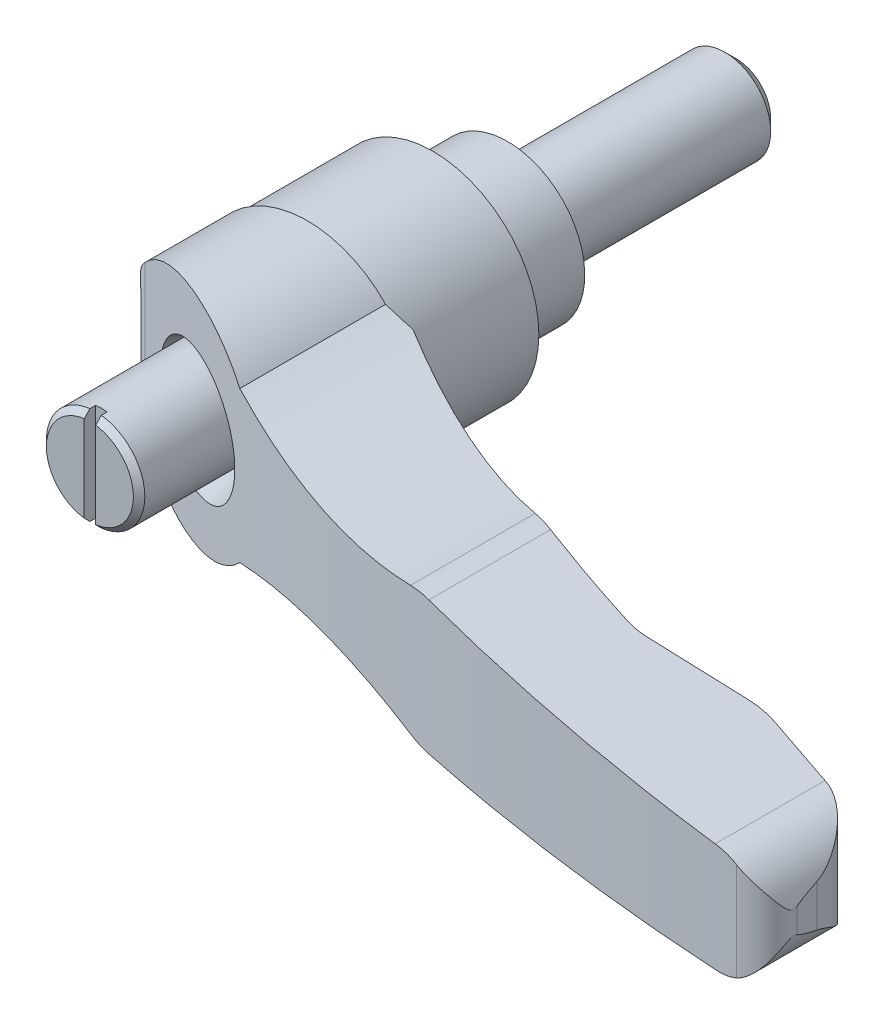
ISO-10303-21;
HEADER;
FILE_DESCRIPTION(('STEP AP214'),'2;1');
FILE_NAME('part.step','',(''),(''),'','','');
FILE_SCHEMA(('AUTOMOTIVE_DESIGN { 1 0 10303 214 1 1 1 1 }'));
ENDSEC;
DATA;
#1=APPLICATION_CONTEXT('core data for automotive mechanical design processes');
#2=APPLICATION_PROTOCOL_DEFINITION('international standard','automotive_design',2000,#1);
#3=PRODUCT_CONTEXT('',#1,'mechanical');
#4=PRODUCT('Part','Part','',(#3));
#5=PRODUCT_RELATED_PRODUCT_CATEGORY('part','',(#4));
#6=PRODUCT_DEFINITION_FORMATION('','',#4);
#7=PRODUCT_DEFINITION_CONTEXT('part definition',#1,'design');
#8=PRODUCT_DEFINITION('design','',#6,#7);
#9=PRODUCT_DEFINITION_SHAPE('','',#8);
#10=(LENGTH_UNIT() NAMED_UNIT(*) SI_UNIT(.MILLI.,.METRE.));
#11=(NAMED_UNIT(*) PLANE_ANGLE_UNIT() SI_UNIT($,.RADIAN.));
#12=(NAMED_UNIT(*) SI_UNIT($,.STERADIAN.) SOLID_ANGLE_UNIT());
#13=UNCERTAINTY_MEASURE_WITH_UNIT(LENGTH_MEASURE(1.E-05),#10,'distance_accuracy_value','');
#14=(GEOMETRIC_REPRESENTATION_CONTEXT(3) GLOBAL_UNCERTAINTY_ASSIGNED_CONTEXT((#13)) GLOBAL_UNIT_ASSIGNED_CONTEXT((#10,
#11,#12)) REPRESENTATION_CONTEXT('',''));
#15=CARTESIAN_POINT('',(0.,0.,0.));
#16=DIRECTION('',(0.,0.,1.));
#17=DIRECTION('',(1.,0.,0.));
#18=AXIS2_PLACEMENT_3D('',#15,#16,#17);
#19=CARTESIAN_POINT('',(-0.010000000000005,0.,20.625));
#20=DIRECTION('',(0.,0.,-1.));
#21=DIRECTION('',(1.,0.,0.));
#22=AXIS2_PLACEMENT_3D('',#19,#20,#21);
#23=CYLINDRICAL_SURFACE('',#22,9.25);
#24=CARTESIAN_POINT('',(-0.0100000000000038,0.,17.5));
#25=DIRECTION('',(0.,0.,1.));
#26=DIRECTION('',(0.,-1.,0.));
#27=AXIS2_PLACEMENT_3D('',#24,#25,#26);
#28=CIRCLE('',#27,9.25);
#29=CARTESIAN_POINT('',(-9.26,0.,17.5));
#30=VERTEX_POINT('',#29);
#31=CARTESIAN_POINT('',(9.24,0.,17.5));
#32=VERTEX_POINT('',#31);
#33=EDGE_CURVE('E242',#30,#32,#28,.T.);
#34=ORIENTED_EDGE('',*,*,#33,.F.);
#35=EDGE_CURVE('E237',#32,#30,#28,.T.);
#36=ORIENTED_EDGE('',*,*,#35,.F.);
#37=EDGE_LOOP('',(#34,#36));
#38=FACE_BOUND('',#37,.T.);
#39=CARTESIAN_POINT('',(-0.00999999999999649,0.,-2.50003775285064));
#40=DIRECTION('',(0.707106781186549,0.,0.707106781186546));
#41=DIRECTION('',(0.707106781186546,0.,-0.707106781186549));
#42=AXIS2_PLACEMENT_3D('',#39,#40,#41);
#43=ELLIPSE('',#42,13.0814754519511,9.25);
#44=CARTESIAN_POINT('',(-9.0100377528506,-2.13584185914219,6.5));
#45=VERTEX_POINT('',#44);
#46=CARTESIAN_POINT('',(-9.0100377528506,2.13584185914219,6.5));
#47=VERTEX_POINT('',#46);
#48=EDGE_CURVE('E514',#45,#47,#43,.F.);
#49=ORIENTED_EDGE('',*,*,#48,.F.);
#50=CARTESIAN_POINT('',(-0.0099999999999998,0.,6.5));
#51=DIRECTION('',(0.,0.,-1.));
#52=DIRECTION('',(1.,0.,0.));
#53=AXIS2_PLACEMENT_3D('',#50,#51,#52);
#54=CIRCLE('',#53,9.25);
#55=EDGE_CURVE('E32',#47,#45,#54,.T.);
#56=ORIENTED_EDGE('',*,*,#55,.F.);
#57=EDGE_LOOP('',(#49,#56));
#58=FACE_BOUND('',#57,.T.);
#59=ADVANCED_FACE('F14',(#38,#58),#23,.T.);
#60=CARTESIAN_POINT('',(-9.26,-19.,6.7499622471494));
#61=DIRECTION('',(0.707106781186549,0.,0.707106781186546));
#62=DIRECTION('',(-0.707106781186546,0.,0.707106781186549));
#63=AXIS2_PLACEMENT_3D('',#60,#61,#62);
#64=PLANE('',#63);
#65=ORIENTED_EDGE('',*,*,#48,.T.);
#66=DIRECTION('',(0.,1.,0.));
#67=VECTOR('',#66,1.);
#68=CARTESIAN_POINT('',(-9.0100377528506,-19.,6.5));
#69=LINE('',#68,#67);
#70=EDGE_CURVE('E85',#45,#47,#69,.T.);
#71=ORIENTED_EDGE('',*,*,#70,.F.);
#72=EDGE_LOOP('',(#65,#71));
#73=FACE_BOUND('',#72,.T.);
#74=ADVANCED_FACE('F497',(#73),#64,.F.);
#75=CARTESIAN_POINT('',(-0.0099999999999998,0.,6.5));
#76=DIRECTION('',(0.,0.,-1.));
#77=DIRECTION('',(1.,0.,0.));
#78=AXIS2_PLACEMENT_3D('',#75,#76,#77);
#79=PLANE('',#78);
#80=CARTESIAN_POINT('',(0.,0.,6.5));
#81=DIRECTION('',(0.,0.,-1.));
#82=DIRECTION('',(1.,0.,0.));
#83=AXIS2_PLACEMENT_3D('',#80,#81,#82);
#84=CIRCLE('',#83,7.);
#85=CARTESIAN_POINT('',(7.,0.,6.5));
#86=VERTEX_POINT('',#85);
#87=EDGE_CURVE('E24',#86,#86,#84,.T.);
#88=ORIENTED_EDGE('',*,*,#87,.F.);
#89=EDGE_LOOP('',(#88));
#90=FACE_BOUND('',#89,.T.);
#91=ORIENTED_EDGE('',*,*,#70,.T.);
#92=ORIENTED_EDGE('',*,*,#55,.T.);
#93=EDGE_LOOP('',(#91,#92));
#94=FACE_BOUND('',#93,.T.);
#95=ADVANCED_FACE('F499',(#90,#94),#79,.T.);
#96=CARTESIAN_POINT('',(0.,0.,6.5));
#97=DIRECTION('',(0.,0.,1.));
#98=DIRECTION('',(0.,-1.,0.));
#99=AXIS2_PLACEMENT_3D('',#96,#97,#98);
#100=CYLINDRICAL_SURFACE('',#99,7.);
#101=ORIENTED_EDGE('',*,*,#87,.T.);
#102=EDGE_LOOP('',(#101));
#103=FACE_BOUND('',#102,.T.);
#104=CARTESIAN_POINT('',(0.,0.,6.9));
#105=DIRECTION('',(0.,0.,1.));
#106=DIRECTION('',(0.,-1.,0.));
#107=AXIS2_PLACEMENT_3D('',#104,#105,#106);
#108=CIRCLE('',#107,7.);
#109=CARTESIAN_POINT('',(0.,-7.,6.9));
#110=VERTEX_POINT('',#109);
#111=EDGE_CURVE('E1145',#110,#110,#108,.T.);
#112=ORIENTED_EDGE('',*,*,#111,.T.);
#113=EDGE_LOOP('',(#112));
#114=FACE_BOUND('',#113,.T.);
#115=ADVANCED_FACE('F501',(#103,#114),#100,.F.);
#116=CARTESIAN_POINT('',(0.,0.,7.15));
#117=DIRECTION('',(0.,0.,-1.));
#118=DIRECTION('',(0.,1.,0.));
#119=AXIS2_PLACEMENT_3D('',#116,#117,#118);
#120=CONICAL_SURFACE('',#119,6.75,0.78539816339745);
#121=ORIENTED_EDGE('',*,*,#111,.F.);
#122=EDGE_LOOP('',(#121));
#123=FACE_BOUND('',#122,.T.);
#124=CARTESIAN_POINT('',(0.,0.,7.15));
#125=DIRECTION('',(0.,0.,1.));
#126=DIRECTION('',(0.,-1.,0.));
#127=AXIS2_PLACEMENT_3D('',#124,#125,#126);
#128=CIRCLE('',#127,6.75);
#129=CARTESIAN_POINT('',(0.,-6.75,7.15));
#130=VERTEX_POINT('',#129);
#131=EDGE_CURVE('E520',#130,#130,#128,.T.);
#132=ORIENTED_EDGE('',*,*,#131,.T.);
#133=EDGE_LOOP('',(#132));
#134=FACE_BOUND('',#133,.T.);
#135=ADVANCED_FACE('F508',(#123,#134),#120,.F.);
#136=CARTESIAN_POINT('',(-9.26,-10.5,17.5));
#137=DIRECTION('',(0.,0.,1.));
#138=DIRECTION('',(0.,-1.,0.));
#139=AXIS2_PLACEMENT_3D('',#136,#137,#138);
#140=PLANE('',#139);
#141=CARTESIAN_POINT('',(19.2499999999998,-44.0899999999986,17.5));
#142=DIRECTION('',(0.,0.,1.));
#143=DIRECTION('',(0.,-1.,0.));
#144=AXIS2_PLACEMENT_3D('',#141,#142,#143);
#145=CIRCLE('',#144,39.4999999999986);
#146=CARTESIAN_POINT('',(6.84374087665,-6.588870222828,17.5));
#147=VERTEX_POINT('',#146);
#148=CARTESIAN_POINT('',(9.24,-5.87940068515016,17.5));
#149=VERTEX_POINT('',#148);
#150=EDGE_CURVE('E584',#147,#149,#145,.F.);
#151=ORIENTED_EDGE('',*,*,#150,.F.);
#152=CARTESIAN_POINT('',(0.,0.,17.5));
#153=DIRECTION('',(0.,0.,1.));
#154=DIRECTION('',(0.,-1.,0.));
#155=AXIS2_PLACEMENT_3D('',#152,#153,#154);
#156=CIRCLE('',#155,9.5);
#157=CARTESIAN_POINT('',(-9.26,-2.12188595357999,17.5));
#158=VERTEX_POINT('',#157);
#159=EDGE_CURVE('E585',#158,#147,#156,.T.);
#160=ORIENTED_EDGE('',*,*,#159,.F.);
#161=DIRECTION('',(0.,1.,0.));
#162=VECTOR('',#161,1.);
#163=CARTESIAN_POINT('',(-9.26,-10.5,17.5));
#164=LINE('',#163,#162);
#165=EDGE_CURVE('E231',#158,#30,#164,.T.);
#166=ORIENTED_EDGE('',*,*,#165,.T.);
#167=ORIENTED_EDGE('',*,*,#33,.T.);
#168=DIRECTION('',(0.,1.,0.));
#169=VECTOR('',#168,1.);
#170=CARTESIAN_POINT('',(9.24,-10.5,17.5));
#171=LINE('',#170,#169);
#172=EDGE_CURVE('E270',#149,#32,#171,.T.);
#173=ORIENTED_EDGE('',*,*,#172,.F.);
#174=EDGE_LOOP('',(#151,#160,#166,#167,#173));
#175=FACE_BOUND('',#174,.T.);
#176=ADVANCED_FACE('F579',(#175),#140,.F.);
#177=CARTESIAN_POINT('',(-9.26,-10.5,21.203824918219));
#178=DIRECTION('',(1.,0.,0.));
#179=DIRECTION('',(0.,1.,0.));
#180=AXIS2_PLACEMENT_3D('',#177,#178,#179);
#181=PLANE('',#180);
#182=DIRECTION('',(0.,0.,1.));
#183=VECTOR('',#182,1.);
#184=CARTESIAN_POINT('',(-9.26,2.12188595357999,0.));
#185=LINE('',#184,#183);
#186=CARTESIAN_POINT('',(-9.26,2.12188595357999,17.5));
#187=VERTEX_POINT('',#186);
#188=CARTESIAN_POINT('',(-9.26,2.12188595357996,21.203824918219));
#189=VERTEX_POINT('',#188);
#190=EDGE_CURVE('E209',#187,#189,#185,.T.);
#191=ORIENTED_EDGE('',*,*,#190,.F.);
#192=EDGE_CURVE('E272',#30,#187,#164,.T.);
#193=ORIENTED_EDGE('',*,*,#192,.F.);
#194=ORIENTED_EDGE('',*,*,#165,.F.);
#195=DIRECTION('',(0.,0.,1.));
#196=VECTOR('',#195,1.);
#197=CARTESIAN_POINT('',(-9.26,-2.12188595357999,0.));
#198=LINE('',#197,#196);
#199=CARTESIAN_POINT('',(-9.26,-2.12188595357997,21.203824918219));
#200=VERTEX_POINT('',#199);
#201=EDGE_CURVE('E236',#200,#158,#198,.F.);
#202=ORIENTED_EDGE('',*,*,#201,.F.);
#203=DIRECTION('',(0.,1.,0.));
#204=VECTOR('',#203,1.);
#205=CARTESIAN_POINT('',(-9.26,-10.5,21.203824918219));
#206=LINE('',#205,#204);
#207=EDGE_CURVE('E227',#200,#189,#206,.T.);
#208=ORIENTED_EDGE('',*,*,#207,.T.);
#209=EDGE_LOOP('',(#191,#193,#194,#202,#208));
#210=FACE_BOUND('',#209,.T.);
#211=ADVANCED_FACE('F234',(#210),#181,.F.);
#212=CARTESIAN_POINT('',(19.2499999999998,44.0899999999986,17.5));
#213=DIRECTION('',(0.,0.,1.));
#214=DIRECTION('',(0.,-1.,0.));
#215=AXIS2_PLACEMENT_3D('',#212,#213,#214);
#216=CIRCLE('',#215,39.4999999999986);
#217=CARTESIAN_POINT('',(9.24,5.87940068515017,17.5));
#218=VERTEX_POINT('',#217);
#219=CARTESIAN_POINT('',(6.84374087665,6.588870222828,17.5));
#220=VERTEX_POINT('',#219);
#221=EDGE_CURVE('E569',#218,#220,#216,.F.);
#222=ORIENTED_EDGE('',*,*,#221,.F.);
#223=EDGE_CURVE('E269',#32,#218,#171,.T.);
#224=ORIENTED_EDGE('',*,*,#223,.F.);
#225=ORIENTED_EDGE('',*,*,#35,.T.);
#226=ORIENTED_EDGE('',*,*,#192,.T.);
#227=CARTESIAN_POINT('',(0.,0.,17.5));
#228=DIRECTION('',(0.,0.,1.));
#229=DIRECTION('',(0.,-1.,0.));
#230=AXIS2_PLACEMENT_3D('',#227,#228,#229);
#231=CIRCLE('',#230,9.5);
#232=EDGE_CURVE('E216',#220,#187,#231,.T.);
#233=ORIENTED_EDGE('',*,*,#232,.F.);
#234=EDGE_LOOP('',(#222,#224,#225,#226,#233));
#235=FACE_BOUND('',#234,.T.);
#236=ADVANCED_FACE('F449',(#235),#140,.F.);
#237=CARTESIAN_POINT('',(42.239481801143,-10.5,23.0800000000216));
#238=DIRECTION('',(0.,1.,0.));
#239=DIRECTION('',(-1.,0.,0.));
#240=AXIS2_PLACEMENT_3D('',#237,#238,#239);
#241=CYLINDRICAL_SURFACE('',#240,6.97999999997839);
#242=CARTESIAN_POINT('',(42.239481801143,5.40097293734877,23.0800000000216));
#243=DIRECTION('',(0.036120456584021,0.999347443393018,0.));
#244=DIRECTION('',(-0.999347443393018,0.036120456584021,0.));
#245=AXIS2_PLACEMENT_3D('',#242,#243,#244);
#246=ELLIPSE('',#245,6.98455781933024,6.97999999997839);
#247=CARTESIAN_POINT('',(42.239481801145,5.4009729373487,30.06));
#248=VERTEX_POINT('',#247);
#249=CARTESIAN_POINT('',(40.302460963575,5.47098470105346,29.785844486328));
#250=VERTEX_POINT('',#249);
#251=EDGE_CURVE('E1218',#248,#250,#246,.F.);
#252=ORIENTED_EDGE('',*,*,#251,.F.);
#253=DIRECTION('',(0.,1.,0.));
#254=VECTOR('',#253,1.);
#255=CARTESIAN_POINT('',(42.239481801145,-10.5,30.06));
#256=LINE('',#255,#254);
#257=CARTESIAN_POINT('',(42.239481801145,-5.4009729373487,30.06));
#258=VERTEX_POINT('',#257);
#259=EDGE_CURVE('E263',#258,#248,#256,.T.);
#260=ORIENTED_EDGE('',*,*,#259,.F.);
#261=CARTESIAN_POINT('',(42.239481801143,-5.40097293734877,23.0800000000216));
#262=DIRECTION('',(0.036120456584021,-0.999347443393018,0.));
#263=DIRECTION('',(0.999347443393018,0.036120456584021,0.));
#264=AXIS2_PLACEMENT_3D('',#261,#262,#263);
#265=ELLIPSE('',#264,6.98455781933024,6.97999999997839);
#266=CARTESIAN_POINT('',(40.302460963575,-5.47098470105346,29.785844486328));
#267=VERTEX_POINT('',#266);
#268=EDGE_CURVE('E600',#267,#258,#265,.F.);
#269=ORIENTED_EDGE('',*,*,#268,.F.);
#270=DIRECTION('',(0.,1.,0.));
#271=VECTOR('',#270,1.);
#272=CARTESIAN_POINT('',(40.302460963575,-10.5,29.785844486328));
#273=LINE('',#272,#271);
#274=EDGE_CURVE('E266',#267,#250,#273,.T.);
#275=ORIENTED_EDGE('',*,*,#274,.T.);
#276=EDGE_LOOP('',(#252,#260,#269,#275));
#277=FACE_BOUND('',#276,.T.);
#278=ADVANCED_FACE('F445',(#277),#241,.F.);
#279=CARTESIAN_POINT('',(42.239481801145,-10.5,30.06));
#280=DIRECTION('',(0.,0.,1.));
#281=DIRECTION('',(0.,-1.,0.));
#282=AXIS2_PLACEMENT_3D('',#279,#280,#281);
#283=PLANE('',#282);
#284=DIRECTION('',(-0.999347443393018,0.036120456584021,0.));
#285=VECTOR('',#284,1.);
#286=CARTESIAN_POINT('',(42.8134574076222,5.38022713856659,30.06));
#287=LINE('',#286,#285);
#288=CARTESIAN_POINT('',(51.078035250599,5.08151188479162,30.06));
#289=VERTEX_POINT('',#288);
#290=EDGE_CURVE('E1217',#289,#248,#287,.T.);
#291=ORIENTED_EDGE('',*,*,#290,.F.);
#292=DIRECTION('',(0.,1.,0.));
#293=VECTOR('',#292,1.);
#294=CARTESIAN_POINT('',(51.078035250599,-10.5,30.06));
#295=LINE('',#294,#293);
#296=CARTESIAN_POINT('',(51.078035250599,-5.08151188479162,30.06));
#297=VERTEX_POINT('',#296);
#298=EDGE_CURVE('E260',#297,#289,#295,.T.);
#299=ORIENTED_EDGE('',*,*,#298,.F.);
#300=DIRECTION('',(0.999347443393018,0.036120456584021,0.));
#301=VECTOR('',#300,1.);
#302=CARTESIAN_POINT('',(42.0554228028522,-5.40762557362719,30.06));
#303=LINE('',#302,#301);
#304=EDGE_CURVE('E602',#258,#297,#303,.T.);
#305=ORIENTED_EDGE('',*,*,#304,.F.);
#306=ORIENTED_EDGE('',*,*,#259,.T.);
#307=EDGE_LOOP('',(#291,#299,#305,#306));
#308=FACE_BOUND('',#307,.T.);
#309=ADVANCED_FACE('F441',(#308),#283,.F.);
#310=CARTESIAN_POINT('',(51.0780352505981,-10.5,39.2200000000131));
#311=DIRECTION('',(0.,1.,0.));
#312=DIRECTION('',(-1.,0.,0.));
#313=AXIS2_PLACEMENT_3D('',#310,#311,#312);
#314=CYLINDRICAL_SURFACE('',#313,9.16000000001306);
#315=CARTESIAN_POINT('',(51.0780352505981,5.08151188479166,39.2200000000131));
#316=DIRECTION('',(0.036120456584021,0.999347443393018,0.));
#317=DIRECTION('',(-0.999347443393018,0.036120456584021,0.));
#318=AXIS2_PLACEMENT_3D('',#315,#316,#317);
#319=ELLIPSE('',#318,9.165981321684,9.16000000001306);
#320=CARTESIAN_POINT('',(53.829450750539,4.98206460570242,30.482991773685));
#321=VERTEX_POINT('',#320);
#322=EDGE_CURVE('E615',#321,#289,#319,.T.);
#323=ORIENTED_EDGE('',*,*,#322,.F.);
#324=DIRECTION('',(0.,1.,0.));
#325=VECTOR('',#324,1.);
#326=CARTESIAN_POINT('',(53.829450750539,-10.5,30.482991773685));
#327=LINE('',#326,#325);
#328=CARTESIAN_POINT('',(53.829450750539,-4.98206460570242,30.482991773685));
#329=VERTEX_POINT('',#328);
#330=EDGE_CURVE('E257',#329,#321,#327,.T.);
#331=ORIENTED_EDGE('',*,*,#330,.F.);
#332=CARTESIAN_POINT('',(51.0780352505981,-5.08151188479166,39.2200000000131));
#333=DIRECTION('',(0.036120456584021,-0.999347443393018,0.));
#334=DIRECTION('',(0.999347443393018,0.036120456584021,0.));
#335=AXIS2_PLACEMENT_3D('',#332,#333,#334);
#336=ELLIPSE('',#335,9.165981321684,9.16000000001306);
#337=EDGE_CURVE('E606',#297,#329,#336,.T.);
#338=ORIENTED_EDGE('',*,*,#337,.F.);
#339=ORIENTED_EDGE('',*,*,#298,.T.);
#340=EDGE_LOOP('',(#323,#331,#338,#339));
#341=FACE_BOUND('',#340,.T.);
#342=ADVANCED_FACE('F438',(#341),#314,.T.);
#343=CARTESIAN_POINT('',(88.9416647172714,-10.5,-138.600024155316));
#344=DIRECTION('',(0.,1.,0.));
#345=DIRECTION('',(-1.,0.,0.));
#346=AXIS2_PLACEMENT_3D('',#343,#344,#345);
#347=CYLINDRICAL_SURFACE('',#346,175.269999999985);
#348=CARTESIAN_POINT('',(28.237973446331,-5.6261685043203,25.8220995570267));
#349=CARTESIAN_POINT('',(28.4107669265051,-5.66655022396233,25.8858955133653));
#350=CARTESIAN_POINT('',(28.5848476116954,-5.70116065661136,25.9498539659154));
#351=CARTESIAN_POINT('',(28.9342210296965,-5.75862584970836,26.0775818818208));
#352=CARTESIAN_POINT('',(29.1095064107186,-5.78152582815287,26.1413511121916));
#353=CARTESIAN_POINT('',(29.4612825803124,-5.81567270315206,26.2686873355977));
#354=CARTESIAN_POINT('',(29.6377733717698,-5.82691957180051,26.3322543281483));
#355=CARTESIAN_POINT('',(29.9919650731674,-5.83772087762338,26.4591818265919));
#356=CARTESIAN_POINT('',(30.1696680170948,-5.83722946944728,26.5225405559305));
#357=CARTESIAN_POINT('',(30.347286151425,-5.8308049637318,26.5855433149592));
#358=B_SPLINE_CURVE_WITH_KNOTS('',3,(#348,#349,#350,#351,#352,#353,#354,#355,#356,#357),
.UNSPECIFIED.,.F.,.F.,(4,2,2,2,4),(0.,0.565611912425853,1.12902299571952,1.692435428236,
2.25804869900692),.UNSPECIFIED.);
#359=CARTESIAN_POINT('',(28.237973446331,-5.6261685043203,25.8220995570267));
#360=VERTEX_POINT('',#359);
#361=CARTESIAN_POINT('',(30.347286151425,-5.8308049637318,26.5855433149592));
#362=VERTEX_POINT('',#361);
#363=EDGE_CURVE('E469',#360,#362,#358,.T.);
#364=ORIENTED_EDGE('',*,*,#363,.F.);
#365=CARTESIAN_POINT('',(9.24,-5.87940068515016,17.5));
#366=CARTESIAN_POINT('',(9.79948003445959,-5.73283344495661,17.7856672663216));
#367=CARTESIAN_POINT('',(10.3630165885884,-5.59833643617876,18.0695987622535));
#368=CARTESIAN_POINT('',(11.4974282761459,-5.35391463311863,18.633444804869));
#369=CARTESIAN_POINT('',(12.0683039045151,-5.24399150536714,18.913359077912));
#370=CARTESIAN_POINT('',(13.2171050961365,-5.04907387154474,19.4688580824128));
#371=CARTESIAN_POINT('',(13.7950370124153,-4.9641038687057,19.7444383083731));
#372=CARTESIAN_POINT('',(14.9564491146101,-4.81968144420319,20.2904183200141));
#373=CARTESIAN_POINT('',(15.5399291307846,-4.7602282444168,20.5608182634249));
#374=CARTESIAN_POINT('',(17.274544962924,-4.62260622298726,21.3530632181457));
#375=CARTESIAN_POINT('',(18.4324989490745,-4.58133087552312,21.8669029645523));
#376=CARTESIAN_POINT('',(20.7578250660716,-4.6016852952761,22.8686662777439));
#377=CARTESIAN_POINT('',(21.9251896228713,-4.66323920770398,23.3566086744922));
#378=CARTESIAN_POINT('',(23.5210667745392,-4.81923174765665,24.0035807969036));
#379=CARTESIAN_POINT('',(23.9492706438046,-4.86815262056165,24.1752006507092));
#380=CARTESIAN_POINT('',(24.8053598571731,-4.98022826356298,24.5144113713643));
#381=CARTESIAN_POINT('',(25.2332452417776,-5.04338071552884,24.6820028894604));
#382=CARTESIAN_POINT('',(26.0913487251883,-5.18451989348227,25.0142291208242));
#383=CARTESIAN_POINT('',(26.5215613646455,-5.26261041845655,25.1788337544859));
#384=CARTESIAN_POINT('',(27.3808012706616,-5.43340913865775,25.5037363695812));
#385=CARTESIAN_POINT('',(27.8098283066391,-5.5261199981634,25.6640335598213));
#386=CARTESIAN_POINT('',(28.237973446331,-5.62616850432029,25.8220995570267));
#387=B_SPLINE_CURVE_WITH_KNOTS('',3,(#365,#366,#367,#368,#369,#370,#371,#372,#373,#374,#375,
#376,#377,#378,#379,#380,#381,#382,#383,#384,#385,#386),.UNSPECIFIED.,.F.,.F.,(4,2,2,2,2,2,2,2,
2,2,4),(0.,1.93506781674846,3.87026682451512,5.80735983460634,7.74439376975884,11.5423680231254,
15.337541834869,16.7290778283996,18.120387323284,19.5217408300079,20.9233500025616),.UNSPECIFIED.);
#388=EDGE_CURVE('E459',#149,#360,#387,.T.);
#389=ORIENTED_EDGE('',*,*,#388,.F.);
#390=ORIENTED_EDGE('',*,*,#172,.T.);
#391=ORIENTED_EDGE('',*,*,#223,.T.);
#392=CARTESIAN_POINT('',(28.237973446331,5.62616850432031,25.8220995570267));
#393=CARTESIAN_POINT('',(27.6467124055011,5.48799745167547,25.6038196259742));
#394=CARTESIAN_POINT('',(27.053777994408,5.36383084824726,25.3812778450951));
#395=CARTESIAN_POINT('',(25.8659006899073,5.14331117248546,24.9280288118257));
#396=CARTESIAN_POINT('',(25.2709579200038,5.0469564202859,24.6973220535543));
#397=CARTESIAN_POINT('',(24.0803912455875,4.88185687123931,24.2280988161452));
#398=CARTESIAN_POINT('',(23.4847674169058,4.81310925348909,23.9895831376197));
#399=CARTESIAN_POINT('',(22.2940534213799,4.70292970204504,23.5051335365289));
#400=CARTESIAN_POINT('',(21.6989632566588,4.66149787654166,23.2591995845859));
#401=CARTESIAN_POINT('',(19.9382363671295,4.57874286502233,22.5201121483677));
#402=CARTESIAN_POINT('',(18.7748149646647,4.57591682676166,22.0168726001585));
#403=CARTESIAN_POINT('',(16.4631439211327,4.67145944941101,20.9870607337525));
#404=CARTESIAN_POINT('',(15.3148886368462,4.76978933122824,20.4604974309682));
#405=CARTESIAN_POINT('',(13.7610005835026,4.97097993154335,19.7276539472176));
#406=CARTESIAN_POINT('',(13.34559469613,5.03153416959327,19.5297267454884));
#407=CARTESIAN_POINT('',(12.5181281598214,5.16561835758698,19.1314774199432));
#408=CARTESIAN_POINT('',(12.1060667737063,5.23914536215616,18.9311558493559));
#409=CARTESIAN_POINT('',(11.2826997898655,5.39957122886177,18.5268986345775));
#410=CARTESIAN_POINT('',(10.8714191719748,5.48655913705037,18.3229475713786));
#411=CARTESIAN_POINT('',(10.052717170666,5.67338492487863,17.9129677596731));
#412=CARTESIAN_POINT('',(9.64529662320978,5.77322552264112,17.7069385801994));
#413=CARTESIAN_POINT('',(9.24,5.87940068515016,17.5));
#414=B_SPLINE_CURVE_WITH_KNOTS('',3,(#392,#393,#394,#395,#396,#397,#398,#399,#400,#401,#402,
#403,#404,#405,#406,#407,#408,#409,#410,#411,#412,#413),.UNSPECIFIED.,.F.,.F.,(4,2,2,2,2,2,2,2,
2,2,4),(0.,1.93549726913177,3.87087760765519,5.8060601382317,7.74125033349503,11.5393004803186,
15.3358951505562,16.7281050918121,18.1199993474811,19.5215293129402,20.9233561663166),.UNSPECIFIED.);
#415=CARTESIAN_POINT('',(28.237973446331,5.6261685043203,25.8220995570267));
#416=VERTEX_POINT('',#415);
#417=EDGE_CURVE('E482',#416,#218,#414,.T.);
#418=ORIENTED_EDGE('',*,*,#417,.F.);
#419=CARTESIAN_POINT('',(30.347286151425,5.8308049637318,26.5855433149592));
#420=CARTESIAN_POINT('',(30.1696680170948,5.83722946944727,26.5225405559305));
#421=CARTESIAN_POINT('',(29.9919650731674,5.83772087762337,26.4591818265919));
#422=CARTESIAN_POINT('',(29.6377733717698,5.82691957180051,26.3322543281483));
#423=CARTESIAN_POINT('',(29.4612825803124,5.81567270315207,26.2686873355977));
#424=CARTESIAN_POINT('',(29.1095064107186,5.78152582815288,26.1413511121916));
#425=CARTESIAN_POINT('',(28.9342210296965,5.75862584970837,26.0775818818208));
#426=CARTESIAN_POINT('',(28.5848476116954,5.70116065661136,25.9498539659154));
#427=CARTESIAN_POINT('',(28.4107669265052,5.66655022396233,25.8858955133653));
#428=CARTESIAN_POINT('',(28.237973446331,5.6261685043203,25.8220995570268));
#429=B_SPLINE_CURVE_WITH_KNOTS('',3,(#419,#420,#421,#422,#423,#424,#425,#426,#427,#428),
.UNSPECIFIED.,.F.,.F.,(4,2,2,2,4),(0.,0.56561327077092,1.12902570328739,1.69243678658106,
2.25804869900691),.UNSPECIFIED.);
#430=CARTESIAN_POINT('',(30.347286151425,5.8308049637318,26.5855433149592));
#431=VERTEX_POINT('',#430);
#432=EDGE_CURVE('E476',#431,#416,#429,.T.);
#433=ORIENTED_EDGE('',*,*,#432,.F.);
#434=CARTESIAN_POINT('',(88.9416647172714,3.71296724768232,-138.600024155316));
#435=DIRECTION('',(0.036120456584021,0.999347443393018,0.));
#436=DIRECTION('',(-0.999347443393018,0.036120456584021,0.));
#437=AXIS2_PLACEMENT_3D('',#434,#435,#436);
#438=ELLIPSE('',#437,175.384448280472,175.269999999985);
#439=EDGE_CURVE('E483',#250,#431,#438,.F.);
#440=ORIENTED_EDGE('',*,*,#439,.F.);
#441=ORIENTED_EDGE('',*,*,#274,.F.);
#442=CARTESIAN_POINT('',(88.9416647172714,-3.71296724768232,-138.600024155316));
#443=DIRECTION('',(0.036120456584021,-0.999347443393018,0.));
#444=DIRECTION('',(0.999347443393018,0.036120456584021,0.));
#445=AXIS2_PLACEMENT_3D('',#442,#443,#444);
#446=ELLIPSE('',#445,175.384448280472,175.269999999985);
#447=EDGE_CURVE('E597',#362,#267,#446,.F.);
#448=ORIENTED_EDGE('',*,*,#447,.F.);
#449=EDGE_LOOP('',(#364,#389,#390,#391,#418,#433,#440,#441,#448));
#450=FACE_BOUND('',#449,.T.);
#451=ADVANCED_FACE('F431',(#450),#347,.F.);
#452=CARTESIAN_POINT('',(58.6337202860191,-10.5,38.3283479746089));
#453=DIRECTION('',(0.,1.,0.));
#454=DIRECTION('',(-1.,0.,0.));
#455=AXIS2_PLACEMENT_3D('',#452,#453,#454);
#456=CYLINDRICAL_SURFACE('',#455,6.04000000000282);
#457=CARTESIAN_POINT('',(60.447972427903,-4.74587261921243,32.567263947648));
#458=CARTESIAN_POINT('',(60.5755504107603,-4.74057354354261,32.6074069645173));
#459=CARTESIAN_POINT('',(60.7015088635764,-4.73014540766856,32.6517620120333));
#460=CARTESIAN_POINT('',(60.9490652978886,-4.69992242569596,32.7481786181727));
#461=CARTESIAN_POINT('',(61.0706698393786,-4.68014236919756,32.8002279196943));
#462=CARTESIAN_POINT('',(61.3074659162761,-4.63235500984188,32.9108206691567));
#463=CARTESIAN_POINT('',(61.4227141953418,-4.6044427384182,32.9692844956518));
#464=CARTESIAN_POINT('',(61.647717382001,-4.54120548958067,33.0925213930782));
#465=CARTESIAN_POINT('',(61.7574696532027,-4.50587699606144,33.1572974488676));
#466=CARTESIAN_POINT('',(61.9940137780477,-4.42040174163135,33.3070323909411));
#467=CARTESIAN_POINT('',(62.119393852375,-4.36870213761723,33.3933358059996));
#468=CARTESIAN_POINT('',(62.3610721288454,-4.25718277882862,33.5732278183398));
#469=CARTESIAN_POINT('',(62.4773638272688,-4.19735729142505,33.666821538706));
#470=CARTESIAN_POINT('',(62.7012840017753,-4.07066877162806,33.8608437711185));
#471=CARTESIAN_POINT('',(62.8088611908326,-4.00376876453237,33.9613071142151));
#472=CARTESIAN_POINT('',(63.0146476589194,-3.86453813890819,34.1677809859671));
#473=CARTESIAN_POINT('',(63.1128596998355,-3.79220913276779,34.2737898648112));
#474=CARTESIAN_POINT('',(63.3331746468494,-3.61700510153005,34.5290929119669));
#475=CARTESIAN_POINT('',(63.4514763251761,-3.51235864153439,34.6804594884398));
#476=CARTESIAN_POINT('',(63.6718053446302,-3.29808480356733,34.9913387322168));
#477=CARTESIAN_POINT('',(63.7738256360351,-3.1884552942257,35.1508548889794));
#478=CARTESIAN_POINT('',(63.9616621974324,-2.96765680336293,35.4770445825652));
#479=CARTESIAN_POINT('',(64.047537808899,-2.85649513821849,35.6436890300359));
#480=CARTESIAN_POINT('',(64.2038484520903,-2.63586419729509,35.9851508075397));
#481=CARTESIAN_POINT('',(64.2742871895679,-2.52639452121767,36.1599661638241));
#482=CARTESIAN_POINT('',(64.3705847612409,-2.36382517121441,36.4361542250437));
#483=CARTESIAN_POINT('',(64.4019853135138,-2.30809068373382,36.5340606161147));
#484=CARTESIAN_POINT('',(64.4601539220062,-2.20019362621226,36.7330390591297));
#485=CARTESIAN_POINT('',(64.4869269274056,-2.14802727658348,36.8341075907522));
#486=CARTESIAN_POINT('',(64.5357331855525,-2.04890785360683,37.0402846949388));
#487=CARTESIAN_POINT('',(64.5577546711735,-2.00196785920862,37.1454025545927));
#488=CARTESIAN_POINT('',(64.5966140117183,-1.91618262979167,37.360168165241));
#489=CARTESIAN_POINT('',(64.6134353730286,-1.87736327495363,37.4698291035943));
#490=CARTESIAN_POINT('',(64.62740519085,-1.84413226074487,37.581795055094));
#491=B_SPLINE_CURVE_WITH_KNOTS('',3,(#457,#458,#459,#460,#461,#462,#463,#464,#465,#466,#467,
#468,#469,#470,#471,#472,#473,#474,#475,#476,#477,#478,#479,#480,#481,#482,#483,#484,#485,#486,
#487,#488,#489,#490),.UNSPECIFIED.,.F.,.F.,(4,2,2,2,2,2,2,2,2,2,2,2,2,2,2,2,4),(0.,
0.401264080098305,0.801895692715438,1.19802151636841,1.5943355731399,2.07588331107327,
2.55777255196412,3.04231807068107,3.52672024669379,4.18208013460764,4.83772302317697,
5.49090678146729,6.14393356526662,6.49464389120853,6.84497677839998,7.19616755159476,
7.54846105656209),.UNSPECIFIED.);
#492=CARTESIAN_POINT('',(60.447972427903,-4.74587261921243,32.567263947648));
#493=VERTEX_POINT('',#492);
#494=CARTESIAN_POINT('',(64.62740519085,-1.84413226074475,37.581795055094));
#495=VERTEX_POINT('',#494);
#496=EDGE_CURVE('E417',#493,#495,#491,.T.);
#497=ORIENTED_EDGE('',*,*,#496,.F.);
#498=DIRECTION('',(0.,1.,0.));
#499=VECTOR('',#498,1.);
#500=CARTESIAN_POINT('',(60.447972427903,-10.5,32.567263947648));
#501=LINE('',#500,#499);
#502=CARTESIAN_POINT('',(60.447972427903,4.74587261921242,32.567263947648));
#503=VERTEX_POINT('',#502);
#504=EDGE_CURVE('E254',#493,#503,#501,.T.);
#505=ORIENTED_EDGE('',*,*,#504,.T.);
#506=CARTESIAN_POINT('',(64.62740519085,1.84413226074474,37.581795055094));
#507=CARTESIAN_POINT('',(64.617586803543,1.86745330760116,37.5030045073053));
#508=CARTESIAN_POINT('',(64.6063375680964,1.89362327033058,37.4253204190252));
#509=CARTESIAN_POINT('',(64.5811702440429,1.95049016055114,37.2721928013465));
#510=CARTESIAN_POINT('',(64.5672561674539,1.98118026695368,37.1967460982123));
#511=CARTESIAN_POINT('',(64.5369883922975,2.0458503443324,37.0482136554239));
#512=CARTESIAN_POINT('',(64.520645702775,2.07981523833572,36.9751189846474));
#513=CARTESIAN_POINT('',(64.4855821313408,2.15032519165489,36.830739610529));
#514=CARTESIAN_POINT('',(64.4668602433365,2.18687133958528,36.75945568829));
#515=CARTESIAN_POINT('',(64.4072221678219,2.29938724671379,36.5479610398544));
#516=CARTESIAN_POINT('',(64.3628565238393,2.3781837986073,36.4102182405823));
#517=CARTESIAN_POINT('',(64.2652007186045,2.53960895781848,36.1400450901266));
#518=CARTESIAN_POINT('',(64.2118976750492,2.6222429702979,36.0076227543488));
#519=CARTESIAN_POINT('',(64.0771192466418,2.8167231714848,35.7040219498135));
#520=CARTESIAN_POINT('',(63.9921849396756,2.92909268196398,35.5347005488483));
#521=CARTESIAN_POINT('',(63.8063278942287,3.15216626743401,35.2039790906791));
#522=CARTESIAN_POINT('',(63.7054078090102,3.26287061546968,35.0425777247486));
#523=CARTESIAN_POINT('',(63.4870671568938,3.47959027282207,34.7278934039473));
#524=CARTESIAN_POINT('',(63.3696459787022,3.58560540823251,34.5746107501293));
#525=CARTESIAN_POINT('',(63.1179209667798,3.78996521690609,34.2772360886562));
#526=CARTESIAN_POINT('',(62.9836257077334,3.88831374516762,34.1331394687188));
#527=CARTESIAN_POINT('',(62.6561598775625,4.10136712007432,33.8153134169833));
#528=CARTESIAN_POINT('',(62.457188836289,4.21258905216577,33.6450495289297));
#529=CARTESIAN_POINT('',(62.1378586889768,4.36029911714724,33.406945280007));
#530=CARTESIAN_POINT('',(62.0281124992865,4.40629516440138,33.3305585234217));
#531=CARTESIAN_POINT('',(61.8018114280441,4.49098569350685,33.1841350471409));
#532=CARTESIAN_POINT('',(61.6852609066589,4.5296847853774,33.1140943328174));
#533=CARTESIAN_POINT('',(61.4786111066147,4.58924867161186,32.9993621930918));
#534=CARTESIAN_POINT('',(61.3900115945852,4.61209493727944,32.9529824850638));
#535=CARTESIAN_POINT('',(61.2097340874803,4.65295056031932,32.864298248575));
#536=CARTESIAN_POINT('',(61.1180570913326,4.67096147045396,32.8219924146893));
#537=CARTESIAN_POINT('',(60.9313596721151,4.70183469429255,32.7415027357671));
#538=CARTESIAN_POINT('',(60.8363219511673,4.71466416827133,32.7033462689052));
#539=CARTESIAN_POINT('',(60.643828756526,4.73463763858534,32.6317122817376));
#540=CARTESIAN_POINT('',(60.5463713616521,4.74177695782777,32.5982386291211));
#541=CARTESIAN_POINT('',(60.447972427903,4.74587261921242,32.567263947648));
#542=B_SPLINE_CURVE_WITH_KNOTS('',3,(#506,#507,#508,#509,#510,#511,#512,#513,#514,#515,#516,
#517,#518,#519,#520,#521,#522,#523,#524,#525,#526,#527,#528,#529,#530,#531,#532,#533,#534,#535,
#536,#537,#538,#539,#540,#541),.UNSPECIFIED.,.F.,.F.,(4,2,2,2,2,2,2,2,2,2,2,2,2,2,2,2,2,4),(0.,
0.248076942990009,0.495783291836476,0.742399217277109,0.98911977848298,1.48293160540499,
1.97746142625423,2.63745339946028,3.29733594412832,3.95724294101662,4.61681594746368,
5.46693586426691,5.89075482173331,6.31430511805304,6.62183365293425,6.92926331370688,
7.23861197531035,7.54821464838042),.UNSPECIFIED.);
#543=CARTESIAN_POINT('',(64.62740519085,1.84413226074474,37.581795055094));
#544=VERTEX_POINT('',#543);
#545=EDGE_CURVE('E402',#544,#503,#542,.T.);
#546=ORIENTED_EDGE('',*,*,#545,.F.);
#547=DIRECTION('',(0.,1.,0.));
#548=VECTOR('',#547,1.);
#549=CARTESIAN_POINT('',(64.62740519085,-10.5,37.581795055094));
#550=LINE('',#549,#548);
#551=EDGE_CURVE('E251',#495,#544,#550,.T.);
#552=ORIENTED_EDGE('',*,*,#551,.F.);
#553=EDGE_LOOP('',(#497,#505,#546,#552));
#554=FACE_BOUND('',#553,.T.);
#555=ADVANCED_FACE('F426',(#554),#456,.T.);
#556=CARTESIAN_POINT('',(64.62740519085,-10.5,37.581795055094));
#557=DIRECTION('',(-0.992331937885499,0.,0.123601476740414));
#558=DIRECTION('',(-0.123601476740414,0.,-0.992331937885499));
#559=AXIS2_PLACEMENT_3D('',#556,#557,#558);
#560=PLANE('',#559);
#561=CARTESIAN_POINT('',(60.25,0.,2.43788666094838));
#562=DIRECTION('',(-0.992331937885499,0.,0.123601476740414));
#563=DIRECTION('',(0.123601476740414,0.,0.992331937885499));
#564=AXIS2_PLACEMENT_3D('',#561,#562,#563);
#565=ELLIPSE('',#564,38.429961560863,4.75);
#566=CARTESIAN_POINT('',(64.874540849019,1.08449155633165,39.565918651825));
#567=VERTEX_POINT('',#566);
#568=EDGE_CURVE('E601',#567,#544,#565,.T.);
#569=ORIENTED_EDGE('',*,*,#568,.F.);
#570=DIRECTION('',(0.,1.,0.));
#571=VECTOR('',#570,1.);
#572=CARTESIAN_POINT('',(64.874540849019,-10.5,39.565918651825));
#573=LINE('',#572,#571);
#574=CARTESIAN_POINT('',(64.874540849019,-1.08449155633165,39.565918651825));
#575=VERTEX_POINT('',#574);
#576=EDGE_CURVE('E248',#575,#567,#573,.T.);
#577=ORIENTED_EDGE('',*,*,#576,.F.);
#578=EDGE_CURVE('E415',#495,#575,#565,.T.);
#579=ORIENTED_EDGE('',*,*,#578,.F.);
#580=ORIENTED_EDGE('',*,*,#551,.T.);
#581=EDGE_LOOP('',(#569,#577,#579,#580));
#582=FACE_BOUND('',#581,.T.);
#583=ADVANCED_FACE('F430',(#582),#560,.F.);
#584=CARTESIAN_POINT('',(53.829450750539,-10.5,30.482991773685));
#585=DIRECTION('',(-0.300372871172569,0.,0.95382185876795));
#586=DIRECTION('',(-0.95382185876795,0.,-0.300372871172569));
#587=AXIS2_PLACEMENT_3D('',#584,#585,#586);
#588=PLANE('',#587);
#589=DIRECTION('',(-0.953255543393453,0.0344545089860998,-0.300194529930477));
#590=VECTOR('',#589,1.);
#591=CARTESIAN_POINT('',(54.3379429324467,4.96368564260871,30.6431236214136));
#592=LINE('',#591,#590);
#593=CARTESIAN_POINT('',(60.25,4.75,32.5049194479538));
#594=VERTEX_POINT('',#593);
#595=EDGE_CURVE('E424',#594,#321,#592,.T.);
#596=ORIENTED_EDGE('',*,*,#595,.F.);
#597=CARTESIAN_POINT('',(60.25,0.,32.5049194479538));
#598=DIRECTION('',(-0.300372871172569,0.,0.95382185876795));
#599=DIRECTION('',(0.95382185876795,0.,0.300372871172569));
#600=AXIS2_PLACEMENT_3D('',#597,#598,#599);
#601=ELLIPSE('',#600,4.97996555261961,4.75);
#602=EDGE_CURVE('E416',#503,#594,#601,.T.);
#603=ORIENTED_EDGE('',*,*,#602,.F.);
#604=ORIENTED_EDGE('',*,*,#504,.F.);
#605=CARTESIAN_POINT('',(60.25,-4.75,32.5049194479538));
#606=VERTEX_POINT('',#605);
#607=EDGE_CURVE('E423',#606,#493,#601,.T.);
#608=ORIENTED_EDGE('',*,*,#607,.F.);
#609=DIRECTION('',(0.953255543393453,0.0344545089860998,0.300194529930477));
#610=VECTOR('',#609,1.);
#611=CARTESIAN_POINT('',(53.6482199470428,-4.98861501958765,30.4259194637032));
#612=LINE('',#611,#610);
#613=EDGE_CURVE('E596',#329,#606,#612,.T.);
#614=ORIENTED_EDGE('',*,*,#613,.F.);
#615=ORIENTED_EDGE('',*,*,#330,.T.);
#616=EDGE_LOOP('',(#596,#603,#604,#608,#614,#615));
#617=FACE_BOUND('',#616,.T.);
#618=ADVANCED_FACE('F433',(#617),#588,.F.);
#619=CARTESIAN_POINT('',(62.4730975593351,-10.5,39.8650342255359));
#620=DIRECTION('',(0.,1.,0.));
#621=DIRECTION('',(-1.,0.,0.));
#622=AXIS2_PLACEMENT_3D('',#619,#620,#621);
#623=CYLINDRICAL_SURFACE('',#622,2.42000000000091);
#624=CARTESIAN_POINT('',(64.874540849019,-1.08449155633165,39.565918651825));
#625=CARTESIAN_POINT('',(64.8785986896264,-1.06718866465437,39.5983671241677));
#626=CARTESIAN_POINT('',(64.8821274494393,-1.05169442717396,39.6321861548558));
#627=CARTESIAN_POINT('',(64.887857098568,-1.02613774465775,39.7020851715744));
#628=CARTESIAN_POINT('',(64.8900508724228,-1.01610443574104,39.7381761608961));
#629=CARTESIAN_POINT('',(64.8925173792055,-1.00476860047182,39.8044107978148));
#630=CARTESIAN_POINT('',(64.8930868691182,-1.00211989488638,39.8342978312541));
#631=CARTESIAN_POINT('',(64.893107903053,-1.00202247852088,39.8939346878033));
#632=CARTESIAN_POINT('',(64.8925646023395,-1.00454978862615,39.9236845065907));
#633=CARTESIAN_POINT('',(64.8901977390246,-1.01543140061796,39.988754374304));
#634=CARTESIAN_POINT('',(64.8881197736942,-1.02494097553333,40.0238668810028));
#635=CARTESIAN_POINT('',(64.8826618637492,-1.04933186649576,40.0921614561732));
#636=CARTESIAN_POINT('',(64.8792751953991,-1.06424089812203,40.1253325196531));
#637=CARTESIAN_POINT('',(64.8707967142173,-1.10051711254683,40.1949883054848));
#638=CARTESIAN_POINT('',(64.865514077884,-1.12254833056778,40.2310942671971));
#639=CARTESIAN_POINT('',(64.8537694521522,-1.16978917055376,40.3009885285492));
#640=CARTESIAN_POINT('',(64.8473052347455,-1.19500476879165,40.3347722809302));
#641=CARTESIAN_POINT('',(64.8263124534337,-1.27389295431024,40.4336855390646));
#642=CARTESIAN_POINT('',(64.8102295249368,-1.3306005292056,40.4960374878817));
#643=CARTESIAN_POINT('',(64.7786166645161,-1.43400674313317,40.6021014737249));
#644=CARTESIAN_POINT('',(64.7638216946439,-1.47998086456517,40.6467854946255));
#645=CARTESIAN_POINT('',(64.7321709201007,-1.57323332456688,40.7340230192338));
#646=CARTESIAN_POINT('',(64.7153150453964,-1.62051170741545,40.7765764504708));
#647=CARTESIAN_POINT('',(64.6616519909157,-1.76357535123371,40.9018121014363));
#648=CARTESIAN_POINT('',(64.6217887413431,-1.86045745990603,40.9819411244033));
#649=CARTESIAN_POINT('',(64.5338775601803,-2.05482553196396,41.1368408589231));
#650=CARTESIAN_POINT('',(64.4858262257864,-2.15231173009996,41.2116093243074));
#651=CARTESIAN_POINT('',(64.3813817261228,-2.34655824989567,41.3559330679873));
#652=CARTESIAN_POINT('',(64.3249946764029,-2.44331904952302,41.4254921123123));
#653=CARTESIAN_POINT('',(64.2010440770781,-2.63927132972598,41.5619270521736));
#654=CARTESIAN_POINT('',(64.1331103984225,-2.73839405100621,41.6285673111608));
#655=CARTESIAN_POINT('',(63.9875502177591,-2.9339539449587,41.7550430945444));
#656=CARTESIAN_POINT('',(63.9099192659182,-3.03038985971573,41.8148754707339));
#657=CARTESIAN_POINT('',(63.7450090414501,-3.21917021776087,41.9262233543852));
#658=CARTESIAN_POINT('',(63.6577618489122,-3.31152690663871,41.9777651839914));
#659=CARTESIAN_POINT('',(63.4734923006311,-3.49115406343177,42.0709971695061));
#660=CARTESIAN_POINT('',(63.3764795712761,-3.57842940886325,42.1126968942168));
#661=CARTESIAN_POINT('',(63.1547455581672,-3.76151883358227,42.1905140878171));
#662=CARTESIAN_POINT('',(63.0281574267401,-3.85611591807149,42.2243424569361));
#663=CARTESIAN_POINT('',(62.8299301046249,-3.9890861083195,42.2595211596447));
#664=CARTESIAN_POINT('',(62.7625442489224,-4.03187863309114,42.2686518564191));
#665=CARTESIAN_POINT('',(62.6253156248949,-4.11421404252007,42.2812228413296));
#666=CARTESIAN_POINT('',(62.5554745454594,-4.15375910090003,42.2846669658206));
#667=CARTESIAN_POINT('',(62.4501277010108,-4.20992585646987,42.2851722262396));
#668=CARTESIAN_POINT('',(62.4153463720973,-4.2279198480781,42.2845982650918));
#669=CARTESIAN_POINT('',(62.3453991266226,-4.26301931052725,42.2819160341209));
#670=CARTESIAN_POINT('',(62.3102332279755,-4.28012482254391,42.2798078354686));
#671=CARTESIAN_POINT('',(62.274907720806,-4.29677189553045,42.276905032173));
#672=B_SPLINE_CURVE_WITH_KNOTS('',3,(#624,#625,#626,#627,#628,#629,#630,#631,#632,#633,#634,
#635,#636,#637,#638,#639,#640,#641,#642,#643,#644,#645,#646,#647,#648,#649,#650,#651,#652,#653,
#654,#655,#656,#657,#658,#659,#660,#661,#662,#663,#664,#665,#666,#667,#668,#669,#670,#671),
.UNSPECIFIED.,.F.,.F.,(4,2,2,2,2,2,2,2,2,2,2,2,2,2,2,2,2,2,2,2,2,2,2,4),(0.,0.111397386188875,
0.22338343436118,0.31294008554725,0.402082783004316,0.510754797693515,0.619992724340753,
0.747571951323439,0.875394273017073,1.13222687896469,1.32956324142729,1.52690631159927,
1.92215497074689,2.31756828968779,2.71269293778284,3.12442404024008,3.5363447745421,
3.94693069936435,4.35711578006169,4.83979528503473,5.08059190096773,5.32122600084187,
5.43868329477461,5.55613514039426),.UNSPECIFIED.);
#673=CARTESIAN_POINT('',(62.274907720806,-4.29677189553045,42.2769050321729));
#674=VERTEX_POINT('',#673);
#675=EDGE_CURVE('E410',#575,#674,#672,.T.);
#676=ORIENTED_EDGE('',*,*,#675,.F.);
#677=ORIENTED_EDGE('',*,*,#576,.T.);
#678=CARTESIAN_POINT('',(62.274907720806,4.29677189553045,42.276905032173));
#679=CARTESIAN_POINT('',(62.3484429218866,4.26213869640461,42.2829554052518));
#680=CARTESIAN_POINT('',(62.4212610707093,4.2254955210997,42.2855470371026));
#681=CARTESIAN_POINT('',(62.564774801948,4.14860038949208,42.2843574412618));
#682=CARTESIAN_POINT('',(62.6354735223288,4.1083541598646,42.2805861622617));
#683=CARTESIAN_POINT('',(62.7735534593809,4.02500028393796,42.2673020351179));
#684=CARTESIAN_POINT('',(62.8409620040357,3.98192770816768,42.2578508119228));
#685=CARTESIAN_POINT('',(62.9729170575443,3.89288589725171,42.2338060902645));
#686=CARTESIAN_POINT('',(63.037462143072,3.84691524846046,42.2192100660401));
#687=CARTESIAN_POINT('',(63.1798156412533,3.74012323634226,42.1810015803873));
#688=CARTESIAN_POINT('',(63.2566999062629,3.67855248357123,42.1560308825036));
#689=CARTESIAN_POINT('',(63.4051883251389,3.55201688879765,42.0997416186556));
#690=CARTESIAN_POINT('',(63.4767890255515,3.48704987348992,42.0684189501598));
#691=CARTESIAN_POINT('',(63.6841374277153,3.28726383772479,41.9659030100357));
#692=CARTESIAN_POINT('',(63.8117165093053,3.14810402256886,41.8863686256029));
#693=CARTESIAN_POINT('',(64.0078346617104,2.90809595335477,41.7387707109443));
#694=CARTESIAN_POINT('',(64.0822428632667,2.80914674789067,41.6751098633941));
#695=CARTESIAN_POINT('',(64.2213033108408,2.60884800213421,41.5411877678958));
#696=CARTESIAN_POINT('',(64.2859552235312,2.5074983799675,41.4709262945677));
#697=CARTESIAN_POINT('',(64.4056344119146,2.30372384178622,41.3246959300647));
#698=CARTESIAN_POINT('',(64.4606832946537,2.20130190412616,41.2487404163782));
#699=CARTESIAN_POINT('',(64.5615971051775,1.99640423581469,41.0911419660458));
#700=CARTESIAN_POINT('',(64.6074681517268,1.89392858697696,41.0095028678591));
#701=CARTESIAN_POINT('',(64.6724899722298,1.73436568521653,40.8759658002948));
#702=CARTESIAN_POINT('',(64.6946729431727,1.67662827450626,40.8262975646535));
#703=CARTESIAN_POINT('',(64.736101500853,1.56239438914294,40.7242511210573));
#704=CARTESIAN_POINT('',(64.7553449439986,1.50589884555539,40.671870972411));
#705=CARTESIAN_POINT('',(64.7911041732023,1.39440450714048,40.5626124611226));
#706=CARTESIAN_POINT('',(64.8075651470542,1.33945042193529,40.5056705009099));
#707=CARTESIAN_POINT('',(64.8370703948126,1.23458164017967,40.3864037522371));
#708=CARTESIAN_POINT('',(64.8501220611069,1.18465618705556,40.324091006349));
#709=CARTESIAN_POINT('',(64.8661549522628,1.11985818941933,40.2264927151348));
#710=CARTESIAN_POINT('',(64.8707942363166,1.10049352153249,40.1945209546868));
#711=CARTESIAN_POINT('',(64.8789586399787,1.06562552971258,40.1283652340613));
#712=CARTESIAN_POINT('',(64.8824848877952,1.05011829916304,40.0941835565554));
#713=CARTESIAN_POINT('',(64.8876748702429,1.02693288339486,40.029588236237));
#714=CARTESIAN_POINT('',(64.8895529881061,1.01837321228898,39.9995179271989));
#715=CARTESIAN_POINT('',(64.8921785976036,1.00633880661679,39.9383655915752));
#716=CARTESIAN_POINT('',(64.8929291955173,1.00285010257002,39.9072865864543));
#717=CARTESIAN_POINT('',(64.8932153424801,1.00152501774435,39.8449093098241));
#718=CARTESIAN_POINT('',(64.8927474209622,1.00370478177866,39.8136106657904));
#719=CARTESIAN_POINT('',(64.8906454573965,1.01337643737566,39.7517827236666));
#720=CARTESIAN_POINT('',(64.8890063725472,1.02089129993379,39.7212573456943));
#721=CARTESIAN_POINT('',(64.8852969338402,1.03758048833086,39.6696465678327));
#722=CARTESIAN_POINT('',(64.8834575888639,1.04578030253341,39.6482116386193));
#723=CARTESIAN_POINT('',(64.879323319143,1.06393290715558,39.6063556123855));
#724=CARTESIAN_POINT('',(64.8770324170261,1.07387013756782,39.5859274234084));
#725=CARTESIAN_POINT('',(64.874540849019,1.08449155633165,39.565918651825));
#726=B_SPLINE_CURVE_WITH_KNOTS('',3,(#678,#679,#680,#681,#682,#683,#684,#685,#686,#687,#688,
#689,#690,#691,#692,#693,#694,#695,#696,#697,#698,#699,#700,#701,#702,#703,#704,#705,#706,#707,
#708,#709,#710,#711,#712,#713,#714,#715,#716,#717,#718,#719,#720,#721,#722,#723,#724,#725),
.UNSPECIFIED.,.F.,.F.,(4,2,2,2,2,2,2,2,2,2,2,2,2,2,2,2,2,2,2,2,2,2,2,4),(0.,0.244350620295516,
0.488319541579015,0.72968811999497,0.971175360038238,1.27556052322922,1.58014290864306,
2.1920399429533,2.60923519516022,3.02644469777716,3.44270300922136,3.85868287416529,
4.09658232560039,4.33465444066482,4.57697559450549,4.81876687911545,4.93157965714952,
5.04427771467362,5.13787391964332,5.23121179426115,5.32481580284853,5.41882529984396,
5.48780546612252,5.55619684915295),.UNSPECIFIED.);
#727=CARTESIAN_POINT('',(62.274907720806,4.29677189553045,42.2769050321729));
#728=VERTEX_POINT('',#727);
#729=EDGE_CURVE('E394',#728,#567,#726,.T.);
#730=ORIENTED_EDGE('',*,*,#729,.F.);
#731=DIRECTION('',(0.,1.,0.));
#732=VECTOR('',#731,1.);
#733=CARTESIAN_POINT('',(62.274907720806,-10.5,42.276905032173));
#734=LINE('',#733,#732);
#735=EDGE_CURVE('E239',#674,#728,#734,.T.);
#736=ORIENTED_EDGE('',*,*,#735,.F.);
#737=EDGE_LOOP('',(#676,#677,#730,#736));
#738=FACE_BOUND('',#737,.T.);
#739=ADVANCED_FACE('F321',(#738),#623,.T.);
#740=CARTESIAN_POINT('',(60.25,0.,0.));
#741=DIRECTION('',(0.,0.,1.));
#742=DIRECTION('',(0.,-1.,0.));
#743=AXIS2_PLACEMENT_3D('',#740,#741,#742);
#744=CYLINDRICAL_SURFACE('',#743,4.75);
#745=ORIENTED_EDGE('',*,*,#607,.T.);
#746=ORIENTED_EDGE('',*,*,#496,.T.);
#747=ORIENTED_EDGE('',*,*,#578,.T.);
#748=ORIENTED_EDGE('',*,*,#675,.T.);
#749=CARTESIAN_POINT('',(62.274907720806,-4.29677189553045,42.2769050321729));
#750=CARTESIAN_POINT('',(62.1526074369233,-4.3544245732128,42.2668563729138));
#751=CARTESIAN_POINT('',(62.0278544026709,-4.40681781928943,42.2564990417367));
#752=CARTESIAN_POINT('',(61.7743193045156,-4.50079963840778,42.2352210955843));
#753=CARTESIAN_POINT('',(61.6455353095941,-4.54238294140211,42.2243002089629));
#754=CARTESIAN_POINT('',(61.3872932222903,-4.61375080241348,42.2021612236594));
#755=CARTESIAN_POINT('',(61.2578894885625,-4.64373523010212,42.1909520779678));
#756=CARTESIAN_POINT('',(60.9971282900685,-4.69274765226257,42.1681230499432));
#757=CARTESIAN_POINT('',(60.8657720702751,-4.71178234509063,42.1565034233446));
#758=CARTESIAN_POINT('',(60.6537297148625,-4.73349762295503,42.1375484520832));
#759=CARTESIAN_POINT('',(60.5733751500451,-4.73966433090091,42.1303200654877));
#760=CARTESIAN_POINT('',(60.4120161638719,-4.74792732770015,42.1157134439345));
#761=CARTESIAN_POINT('',(60.3310106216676,-4.75000065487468,42.1083345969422));
#762=CARTESIAN_POINT('',(60.25,-4.75,42.1009088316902));
#763=B_SPLINE_CURVE_WITH_KNOTS('',3,(#749,#750,#751,#752,#753,#754,#755,#756,#757,#758,#759,
#760,#761,#762),.UNSPECIFIED.,.F.,.F.,(4,2,2,2,2,2,4),(0.,0.406619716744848,0.813437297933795,
1.21289403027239,1.61210613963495,1.85475447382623,2.09876011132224),.UNSPECIFIED.);
#764=CARTESIAN_POINT('',(60.25,-4.75,42.1009088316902));
#765=VERTEX_POINT('',#764);
#766=EDGE_CURVE('E350',#674,#765,#763,.T.);
#767=ORIENTED_EDGE('',*,*,#766,.T.);
#768=DIRECTION('',(0.,0.,1.));
#769=VECTOR('',#768,1.);
#770=CARTESIAN_POINT('',(60.25,-4.75,0.));
#771=LINE('',#770,#769);
#772=EDGE_CURVE('E535',#606,#765,#771,.T.);
#773=ORIENTED_EDGE('',*,*,#772,.F.);
#774=EDGE_LOOP('',(#745,#746,#747,#748,#767,#773));
#775=FACE_BOUND('',#774,.T.);
#776=ADVANCED_FACE('F379',(#775),#744,.T.);
#777=CARTESIAN_POINT('',(30.347286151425,-5.8308049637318,0.));
#778=DIRECTION('',(0.036120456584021,-0.999347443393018,0.));
#779=DIRECTION('',(0.999347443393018,0.036120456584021,0.));
#780=AXIS2_PLACEMENT_3D('',#777,#778,#779);
#781=PLANE('',#780);
#782=ORIENTED_EDGE('',*,*,#447,.T.);
#783=ORIENTED_EDGE('',*,*,#268,.T.);
#784=ORIENTED_EDGE('',*,*,#304,.T.);
#785=ORIENTED_EDGE('',*,*,#337,.T.);
#786=ORIENTED_EDGE('',*,*,#613,.T.);
#787=ORIENTED_EDGE('',*,*,#772,.T.);
#788=CARTESIAN_POINT('',(79.948199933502,-4.03802742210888,-172.798185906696));
#789=DIRECTION('',(0.036120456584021,-0.999347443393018,0.));
#790=DIRECTION('',(0.999347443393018,0.036120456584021,0.));
#791=AXIS2_PLACEMENT_3D('',#788,#789,#790);
#792=ELLIPSE('',#791,215.940913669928,215.799999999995);
#793=CARTESIAN_POINT('',(30.347286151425,-5.8308049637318,37.2241685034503));
#794=VERTEX_POINT('',#793);
#795=EDGE_CURVE('E554',#765,#794,#792,.T.);
#796=ORIENTED_EDGE('',*,*,#795,.T.);
#797=DIRECTION('',(0.,0.,1.));
#798=VECTOR('',#797,1.);
#799=CARTESIAN_POINT('',(30.347286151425,-5.8308049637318,0.));
#800=LINE('',#799,#798);
#801=EDGE_CURVE('E532',#362,#794,#800,.T.);
#802=ORIENTED_EDGE('',*,*,#801,.F.);
#803=EDGE_LOOP('',(#782,#783,#784,#785,#786,#787,#796,#802));
#804=FACE_BOUND('',#803,.T.);
#805=ADVANCED_FACE('F384',(#804),#781,.T.);
#806=CARTESIAN_POINT('',(30.058322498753,2.16397458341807,0.));
#807=DIRECTION('',(0.,0.,1.));
#808=DIRECTION('',(0.,-1.,0.));
#809=AXIS2_PLACEMENT_3D('',#806,#807,#808);
#810=CYLINDRICAL_SURFACE('',#809,8.00000000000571);
#811=ORIENTED_EDGE('',*,*,#363,.T.);
#812=ORIENTED_EDGE('',*,*,#801,.T.);
#813=CARTESIAN_POINT('',(30.347286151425,-5.8308049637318,37.2241685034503));
#814=CARTESIAN_POINT('',(30.169764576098,-5.83722808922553,37.182244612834));
#815=CARTESIAN_POINT('',(29.992096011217,-5.83772255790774,37.1400457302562));
#816=CARTESIAN_POINT('',(29.6379437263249,-5.82692706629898,37.0554559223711));
#817=CARTESIAN_POINT('',(29.4614581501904,-5.81568604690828,37.013066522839));
#818=CARTESIAN_POINT('',(29.1096639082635,-5.78154481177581,36.9281023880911));
#819=CARTESIAN_POINT('',(28.9343552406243,-5.75864461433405,36.8855276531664));
#820=CARTESIAN_POINT('',(28.5849093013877,-5.70117412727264,36.8002038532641));
#821=CARTESIAN_POINT('',(28.4107799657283,-5.66655555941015,36.7574548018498));
#822=CARTESIAN_POINT('',(28.237973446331,-5.6261685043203,36.7148028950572));
#823=B_SPLINE_CURVE_WITH_KNOTS('',3,(#813,#814,#815,#816,#817,#818,#819,#820,#821,#822),
.UNSPECIFIED.,.F.,.F.,(4,2,2,2,4),(0.,0.547453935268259,1.09263389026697,1.63781298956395,
2.18526606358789),.UNSPECIFIED.);
#824=CARTESIAN_POINT('',(28.237973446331,-5.6261685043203,36.7148028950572));
#825=VERTEX_POINT('',#824);
#826=EDGE_CURVE('E342',#794,#825,#823,.T.);
#827=ORIENTED_EDGE('',*,*,#826,.T.);
#828=DIRECTION('',(0.,0.,1.));
#829=VECTOR('',#828,1.);
#830=CARTESIAN_POINT('',(28.237973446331,-5.6261685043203,0.));
#831=LINE('',#830,#829);
#832=EDGE_CURVE('E529',#360,#825,#831,.T.);
#833=ORIENTED_EDGE('',*,*,#832,.F.);
#834=EDGE_LOOP('',(#811,#812,#827,#833));
#835=FACE_BOUND('',#834,.T.);
#836=ADVANCED_FACE('F587',(#835),#810,.T.);
#837=CARTESIAN_POINT('',(19.2499999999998,-44.0899999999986,0.));
#838=DIRECTION('',(0.,0.,1.));
#839=DIRECTION('',(0.,-1.,0.));
#840=AXIS2_PLACEMENT_3D('',#837,#838,#839);
#841=CYLINDRICAL_SURFACE('',#840,39.4999999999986);
#842=ORIENTED_EDGE('',*,*,#150,.T.);
#843=ORIENTED_EDGE('',*,*,#388,.T.);
#844=ORIENTED_EDGE('',*,*,#832,.T.);
#845=CARTESIAN_POINT('',(28.237973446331,-5.62616850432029,36.7148028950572));
#846=CARTESIAN_POINT('',(27.6682572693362,-5.49303219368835,36.5741969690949));
#847=CARTESIAN_POINT('',(27.0963021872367,-5.37273908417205,36.4305600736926));
#848=CARTESIAN_POINT('',(25.9490943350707,-5.15784726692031,36.1374174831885));
#849=CARTESIAN_POINT('',(25.3738416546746,-5.06324786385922,35.9879119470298));
#850=CARTESIAN_POINT('',(24.2212059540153,-4.89974683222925,35.6832223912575));
#851=CARTESIAN_POINT('',(23.6438230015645,-4.83084439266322,35.5280385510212));
#852=CARTESIAN_POINT('',(22.4880978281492,-4.71866670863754,35.2122362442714));
#853=CARTESIAN_POINT('',(21.9097556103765,-4.67539137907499,35.051617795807));
#854=CARTESIAN_POINT('',(20.2001198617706,-4.58518829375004,34.5690900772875));
#855=CARTESIAN_POINT('',(19.0688079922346,-4.57432475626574,34.2397910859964));
#856=CARTESIAN_POINT('',(16.8150562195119,-4.64900463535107,33.5637052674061));
#857=CARTESIAN_POINT('',(15.6926138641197,-4.73452039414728,33.2169234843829));
#858=CARTESIAN_POINT('',(13.9229389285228,-4.94528992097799,32.6544331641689));
#859=CARTESIAN_POINT('',(13.2703420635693,-5.03968175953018,32.4435502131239));
#860=CARTESIAN_POINT('',(11.9722269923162,-5.26066412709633,32.0172762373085));
#861=CARTESIAN_POINT('',(11.3267073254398,-5.38724787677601,31.8018861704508));
#862=CARTESIAN_POINT('',(10.0356459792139,-5.67400511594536,31.3643601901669));
#863=CARTESIAN_POINT('',(9.39021480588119,-5.83459693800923,31.1421728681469));
#864=CARTESIAN_POINT('',(8.10920895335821,-6.18783089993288,30.694469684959));
#865=CARTESIAN_POINT('',(7.47363613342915,-6.38047900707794,30.4689532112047));
#866=CARTESIAN_POINT('',(6.84374087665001,-6.588870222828,30.2421501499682));
#867=B_SPLINE_CURVE_WITH_KNOTS('',3,(#845,#846,#847,#848,#849,#850,#851,#852,#853,#854,#855,
#856,#857,#858,#859,#860,#861,#862,#863,#864,#865,#866),.UNSPECIFIED.,.F.,.F.,(4,2,2,2,2,2,2,2,
2,2,4),(0.,1.80500142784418,3.60995400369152,5.41484961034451,7.21973922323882,10.7502186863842,
14.279685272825,16.3558418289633,18.4315615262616,20.5344752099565,22.6377807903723),.UNSPECIFIED.);
#868=CARTESIAN_POINT('',(6.84374087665,-6.588870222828,30.2421501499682));
#869=VERTEX_POINT('',#868);
#870=EDGE_CURVE('E335',#825,#869,#867,.T.);
#871=ORIENTED_EDGE('',*,*,#870,.T.);
#872=DIRECTION('',(0.,0.,1.));
#873=VECTOR('',#872,1.);
#874=CARTESIAN_POINT('',(6.84374087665,-6.588870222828,0.));
#875=LINE('',#874,#873);
#876=EDGE_CURVE('E526',#147,#869,#875,.T.);
#877=ORIENTED_EDGE('',*,*,#876,.F.);
#878=EDGE_LOOP('',(#842,#843,#844,#871,#877));
#879=FACE_BOUND('',#878,.T.);
#880=ADVANCED_FACE('F293',(#879),#841,.F.);
#881=CARTESIAN_POINT('',(0.,0.,0.));
#882=DIRECTION('',(0.,0.,1.));
#883=DIRECTION('',(0.,-1.,0.));
#884=AXIS2_PLACEMENT_3D('',#881,#882,#883);
#885=CYLINDRICAL_SURFACE('',#884,9.5);
#886=ORIENTED_EDGE('',*,*,#159,.T.);
#887=ORIENTED_EDGE('',*,*,#876,.T.);
#888=CARTESIAN_POINT('',(6.84374087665,-6.588870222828,30.2421501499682));
#889=CARTESIAN_POINT('',(6.65080045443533,-6.78931825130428,30.1726847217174));
#890=CARTESIAN_POINT('',(6.44961303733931,-6.98062511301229,30.0999344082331));
#891=CARTESIAN_POINT('',(6.03270358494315,-7.34389134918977,29.94842511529));
#892=CARTESIAN_POINT('',(5.816987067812,-7.5158580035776,29.8696684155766));
#893=CARTESIAN_POINT('',(5.3734544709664,-7.83907665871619,29.7068832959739));
#894=CARTESIAN_POINT('',(5.14567410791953,-7.99038552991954,29.6228703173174));
#895=CARTESIAN_POINT('',(4.67931603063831,-8.27213483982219,29.4499214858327));
#896=CARTESIAN_POINT('',(4.44073748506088,-8.40257366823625,29.3609852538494));
#897=CARTESIAN_POINT('',(3.95497881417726,-8.64183737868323,29.1788858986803));
#898=CARTESIAN_POINT('',(3.70781056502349,-8.75069080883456,29.0857285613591));
#899=CARTESIAN_POINT('',(3.20629853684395,-8.94662806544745,28.8956228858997));
#900=CARTESIAN_POINT('',(2.95195219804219,-9.03370401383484,28.798673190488));
#901=CARTESIAN_POINT('',(2.43786340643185,-9.18578796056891,28.601574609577));
#902=CARTESIAN_POINT('',(2.17811924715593,-9.25078886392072,28.5014247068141));
#903=CARTESIAN_POINT('',(1.65503418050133,-9.35853500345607,28.2985542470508));
#904=CARTESIAN_POINT('',(1.39169304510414,-9.40127882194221,28.195833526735));
#905=CARTESIAN_POINT('',(0.850745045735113,-9.46593151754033,27.9835884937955));
#906=CARTESIAN_POINT('',(0.57304691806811,-9.48677267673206,27.8739706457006));
#907=CARTESIAN_POINT('',(0.0174543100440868,-9.5040490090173,27.6533175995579));
#908=CARTESIAN_POINT('',(-0.26044017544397,-9.50048351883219,27.5422823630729));
#909=CARTESIAN_POINT('',(-0.814707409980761,-9.46907255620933,27.3194845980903));
#910=CARTESIAN_POINT('',(-1.0910794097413,-9.44121604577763,27.2077217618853));
#911=CARTESIAN_POINT('',(-1.64035574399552,-9.36142371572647,26.984284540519));
#912=CARTESIAN_POINT('',(-1.91326010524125,-9.30948808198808,26.8726101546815));
#913=CARTESIAN_POINT('',(-2.46330450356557,-9.17958373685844,26.6462310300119));
#914=CARTESIAN_POINT('',(-2.74025729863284,-9.10076570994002,26.5315574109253));
#915=CARTESIAN_POINT('',(-3.2864454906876,-8.9180814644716,26.3041026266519));
#916=CARTESIAN_POINT('',(-3.5556836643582,-8.8142243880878,26.1913207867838));
#917=CARTESIAN_POINT('',(-4.0843364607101,-8.58204223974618,25.968649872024));
#918=CARTESIAN_POINT('',(-4.34375951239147,-8.45373876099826,25.8587583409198));
#919=CARTESIAN_POINT('',(-4.85090228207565,-8.1732932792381,25.6428084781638));
#920=CARTESIAN_POINT('',(-5.09862572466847,-8.02115893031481,25.5367489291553));
#921=CARTESIAN_POINT('',(-5.63245900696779,-7.65837288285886,25.3070697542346));
#922=CARTESIAN_POINT('',(-5.91533954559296,-7.44217556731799,25.184590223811));
#923=CARTESIAN_POINT('',(-6.32150789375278,-7.09368737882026,25.007778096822));
#924=CARTESIAN_POINT('',(-6.45385516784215,-6.97351060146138,24.9499993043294));
#925=CARTESIAN_POINT('',(-6.71211253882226,-6.72529570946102,24.836957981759));
#926=CARTESIAN_POINT('',(-6.83802218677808,-6.59725704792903,24.781695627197));
#927=CARTESIAN_POINT('',(-6.96050280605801,-6.46540027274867,24.727805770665));
#928=B_SPLINE_CURVE_WITH_KNOTS('',3,(#888,#889,#890,#891,#892,#893,#894,#895,#896,#897,#898,
#899,#900,#901,#902,#903,#904,#905,#906,#907,#908,#909,#910,#911,#912,#913,#914,#915,#916,#917,
#918,#919,#920,#921,#922,#923,#924,#925,#926,#927),.UNSPECIFIED.,.F.,.F.,(4,2,2,2,2,2,2,2,2,2,2,
2,2,2,2,2,2,2,2,4),(0.,0.859932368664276,1.71953995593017,2.57673116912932,3.43398848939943,
4.29010435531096,5.14652947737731,6.00322959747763,6.85998427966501,7.75680139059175,
8.65364287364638,9.55089209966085,10.4481343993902,11.3768514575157,12.3052299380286,
13.2327921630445,14.1600570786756,15.2871100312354,15.8504832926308,16.4138957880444),.UNSPECIFIED.);
#929=CARTESIAN_POINT('',(-6.96050280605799,-6.46540027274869,24.727805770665));
#930=VERTEX_POINT('',#929);
#931=EDGE_CURVE('E328',#869,#930,#928,.T.);
#932=ORIENTED_EDGE('',*,*,#931,.T.);
#933=CARTESIAN_POINT('',(-6.96050280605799,-6.46540027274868,24.727805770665));
#934=CARTESIAN_POINT('',(-7.03231779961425,-6.38808599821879,24.6962037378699));
#935=CARTESIAN_POINT('',(-7.10244645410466,-6.31000340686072,24.6627326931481));
#936=CARTESIAN_POINT('',(-7.23932687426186,-6.15248181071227,24.5923336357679));
#937=CARTESIAN_POINT('',(-7.30607941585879,-6.07304312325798,24.5554064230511));
#938=CARTESIAN_POINT('',(-7.50117682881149,-5.83307908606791,24.4399205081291));
#939=CARTESIAN_POINT('',(-7.62451399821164,-5.67074081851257,24.356589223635));
#940=CARTESIAN_POINT('',(-7.85897124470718,-5.34114768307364,24.178205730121));
#941=CARTESIAN_POINT('',(-7.96997106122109,-5.17386167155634,24.0830545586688));
#942=CARTESIAN_POINT('',(-8.17879590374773,-4.83699870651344,23.8828542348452));
#943=CARTESIAN_POINT('',(-8.27661999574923,-4.66742159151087,23.7778043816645));
#944=CARTESIAN_POINT('',(-8.44671903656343,-4.35092903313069,23.5736273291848));
#945=CARTESIAN_POINT('',(-8.52065594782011,-4.20412950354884,23.4756965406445));
#946=CARTESIAN_POINT('',(-8.65917083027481,-3.91089063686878,23.2727600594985));
#947=CARTESIAN_POINT('',(-8.72374447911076,-3.76445149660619,23.1677511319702));
#948=CARTESIAN_POINT('',(-8.84326982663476,-3.47433360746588,22.9503970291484));
#949=CARTESIAN_POINT('',(-8.89826964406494,-3.33064448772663,22.8380926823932));
#950=CARTESIAN_POINT('',(-8.97370463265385,-3.11901479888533,22.6620954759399));
#951=CARTESIAN_POINT('',(-8.9976619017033,-3.04915637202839,22.6022049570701));
#952=CARTESIAN_POINT('',(-9.04316702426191,-2.91142176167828,22.4793240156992));
#953=CARTESIAN_POINT('',(-9.06471558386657,-2.84354500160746,22.4163345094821));
#954=CARTESIAN_POINT('',(-9.10567250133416,-2.70956210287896,22.2851760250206));
#955=CARTESIAN_POINT('',(-9.12503183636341,-2.64351496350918,22.2169308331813));
#956=CARTESIAN_POINT('',(-9.16089909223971,-2.51640073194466,22.0748303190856));
#957=CARTESIAN_POINT('',(-9.1774007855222,-2.45534466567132,22.0009632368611));
#958=CARTESIAN_POINT('',(-9.20406834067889,-2.35315977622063,21.8607904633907));
#959=CARTESIAN_POINT('',(-9.2148423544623,-2.31045828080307,21.7957711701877));
#960=CARTESIAN_POINT('',(-9.23345685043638,-2.23489722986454,21.6602353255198));
#961=CARTESIAN_POINT('',(-9.24132006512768,-2.20196182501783,21.5897668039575));
#962=CARTESIAN_POINT('',(-9.25133632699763,-2.15942561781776,21.4666792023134));
#963=CARTESIAN_POINT('',(-9.2545125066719,-2.14572677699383,21.4156083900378));
#964=CARTESIAN_POINT('',(-9.25887548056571,-2.12679749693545,21.3110773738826));
#965=CARTESIAN_POINT('',(-9.26003136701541,-2.12169866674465,21.2575926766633));
#966=CARTESIAN_POINT('',(-9.26,-2.12188595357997,21.203824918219));
#967=B_SPLINE_CURVE_WITH_KNOTS('',3,(#933,#934,#935,#936,#937,#938,#939,#940,#941,#942,#943,
#944,#945,#946,#947,#948,#949,#950,#951,#952,#953,#954,#955,#956,#957,#958,#959,#960,#961,#962,
#963,#964,#965,#966),.UNSPECIFIED.,.F.,.F.,(4,2,2,2,2,2,2,2,2,2,2,2,2,2,2,2,4),(0.,
0.33038488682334,0.660693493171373,1.32060881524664,1.9864778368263,2.65239403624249,
3.22603471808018,3.7999393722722,4.37087057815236,4.65604961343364,4.94114483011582,
5.23171265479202,5.52290594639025,5.75797862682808,5.9911746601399,6.14937203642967,
6.30996910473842),.UNSPECIFIED.);
#968=EDGE_CURVE('E230',#930,#200,#967,.T.);
#969=ORIENTED_EDGE('',*,*,#968,.T.);
#970=ORIENTED_EDGE('',*,*,#201,.T.);
#971=EDGE_LOOP('',(#886,#887,#932,#969,#970));
#972=FACE_BOUND('',#971,.T.);
#973=ADVANCED_FACE('F288',(#972),#885,.T.);
#974=CARTESIAN_POINT('',(-5.40999999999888,-10.5,21.2038249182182));
#975=DIRECTION('',(0.,1.,0.));
#976=DIRECTION('',(-1.,0.,0.));
#977=AXIS2_PLACEMENT_3D('',#974,#975,#976);
#978=CYLINDRICAL_SURFACE('',#977,3.85000000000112);
#979=ORIENTED_EDGE('',*,*,#968,.F.);
#980=DIRECTION('',(0.,1.,0.));
#981=VECTOR('',#980,1.);
#982=CARTESIAN_POINT('',(-6.96050280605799,-10.5,24.727805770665));
#983=LINE('',#982,#981);
#984=CARTESIAN_POINT('',(-6.96050280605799,6.46540027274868,24.727805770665));
#985=VERTEX_POINT('',#984);
#986=EDGE_CURVE('E229',#930,#985,#983,.T.);
#987=ORIENTED_EDGE('',*,*,#986,.T.);
#988=CARTESIAN_POINT('',(-9.26,2.12188595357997,21.203824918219));
#989=CARTESIAN_POINT('',(-9.2600354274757,2.12167409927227,21.2599023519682));
#990=CARTESIAN_POINT('',(-9.25877696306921,2.12722877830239,21.3156412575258));
#991=CARTESIAN_POINT('',(-9.25405235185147,2.14771550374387,21.4242450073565));
#992=CARTESIAN_POINT('',(-9.25062778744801,2.16247085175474,21.4771440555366));
#993=CARTESIAN_POINT('',(-9.23997766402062,2.20760351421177,21.6031007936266));
#994=CARTESIAN_POINT('',(-9.23173653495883,2.24201817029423,21.6745707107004));
#995=CARTESIAN_POINT('',(-9.21229042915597,2.32064222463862,21.8120663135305));
#996=CARTESIAN_POINT('',(-9.2010570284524,2.36494485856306,21.8780313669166));
#997=CARTESIAN_POINT('',(-9.17027240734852,2.48219665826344,22.0357461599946));
#998=CARTESIAN_POINT('',(-9.1493240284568,2.55864834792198,22.1245651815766));
#999=CARTESIAN_POINT('',(-9.10320463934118,2.71820654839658,22.294928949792));
#1000=CARTESIAN_POINT('',(-9.07802368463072,2.8013284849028,22.3764558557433));
#1001=CARTESIAN_POINT('',(-9.0237058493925,2.97165930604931,22.5344748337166));
#1002=CARTESIAN_POINT('',(-8.99455256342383,3.05888410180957,22.6109439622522));
#1003=CARTESIAN_POINT('',(-8.932565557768,3.23543364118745,22.7596220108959));
#1004=CARTESIAN_POINT('',(-8.89973551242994,3.32475621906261,22.8318350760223));
#1005=CARTESIAN_POINT('',(-8.82780149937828,3.51150625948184,22.9781621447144));
#1006=CARTESIAN_POINT('',(-8.78841063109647,3.60903499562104,23.0520055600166));
#1007=CARTESIAN_POINT('',(-8.7054167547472,3.80487108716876,23.1962207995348));
#1008=CARTESIAN_POINT('',(-8.66181308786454,3.90317856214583,23.2665920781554));
#1009=CARTESIAN_POINT('',(-8.52455945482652,4.19869595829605,23.4730544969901));
#1010=CARTESIAN_POINT('',(-8.42452811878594,4.3963398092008,23.6043705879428));
#1011=CARTESIAN_POINT('',(-8.20766014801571,4.78899164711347,23.8538701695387));
#1012=CARTESIAN_POINT('',(-8.09090934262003,4.984007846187,23.9721155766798));
#1013=CARTESIAN_POINT('',(-7.83983279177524,5.37028861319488,24.1949018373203));
#1014=CARTESIAN_POINT('',(-7.70552570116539,5.5615569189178,24.2994570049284));
#1015=CARTESIAN_POINT('',(-7.46953320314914,5.8719276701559,24.4585623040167));
#1016=CARTESIAN_POINT('',(-7.37307970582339,5.99265929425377,24.5177312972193));
#1017=CARTESIAN_POINT('',(-7.1725287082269,6.2313038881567,24.6286010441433));
#1018=CARTESIAN_POINT('',(-7.06842633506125,6.34921499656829,24.6802969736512));
#1019=CARTESIAN_POINT('',(-6.960502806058,6.46540027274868,24.727805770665));
#1020=B_SPLINE_CURVE_WITH_KNOTS('',3,(#988,#989,#990,#991,#992,#993,#994,#995,#996,#997,#998,
#999,#1000,#1001,#1002,#1003,#1004,#1005,#1006,#1007,#1008,#1009,#1010,#1011,#1012,#1013,#1014,
#1015,#1016,#1017,#1018,#1019),.UNSPECIFIED.,.F.,.F.,(4,2,2,2,2,2,2,2,2,2,2,2,2,2,2,4),(0.,
0.167404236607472,0.331688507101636,0.569582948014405,0.809823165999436,1.16607280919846,
1.5231714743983,1.88179235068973,2.24005798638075,2.62547101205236,3.01094440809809,
3.78252545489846,4.5502788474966,5.3172229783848,5.8132941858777,6.3096842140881),.UNSPECIFIED.);
#1021=EDGE_CURVE('E212',#189,#985,#1020,.T.);
#1022=ORIENTED_EDGE('',*,*,#1021,.F.);
#1023=ORIENTED_EDGE('',*,*,#207,.F.);
#1024=EDGE_LOOP('',(#979,#987,#1022,#1023));
#1025=FACE_BOUND('',#1024,.T.);
#1026=ADVANCED_FACE('F226',(#1025),#978,.T.);
#1027=ORIENTED_EDGE('',*,*,#232,.T.);
#1028=ORIENTED_EDGE('',*,*,#190,.T.);
#1029=ORIENTED_EDGE('',*,*,#1021,.T.);
#1030=CARTESIAN_POINT('',(-6.96050280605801,6.46540027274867,24.727805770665));
#1031=CARTESIAN_POINT('',(-6.76751514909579,6.67319739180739,24.812720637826));
#1032=CARTESIAN_POINT('',(-6.56593625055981,6.87152607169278,24.9010722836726));
#1033=CARTESIAN_POINT('',(-6.14753732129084,7.24823277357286,25.083636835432));
#1034=CARTESIAN_POINT('',(-5.93072374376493,7.42661916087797,25.177847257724));
#1035=CARTESIAN_POINT('',(-5.48415292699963,7.76221196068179,25.3709645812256));
#1036=CARTESIAN_POINT('',(-5.25442707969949,7.91946683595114,25.4698600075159));
#1037=CARTESIAN_POINT('',(-4.78334774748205,8.21258438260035,25.6716366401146));
#1038=CARTESIAN_POINT('',(-4.54199312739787,8.34844495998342,25.7745182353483));
#1039=CARTESIAN_POINT('',(-4.04982256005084,8.59796183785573,25.9832104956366));
#1040=CARTESIAN_POINT('',(-3.79902166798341,8.71165182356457,26.0890164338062));
#1041=CARTESIAN_POINT('',(-3.28925188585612,8.91663164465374,26.3029015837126));
#1042=CARTESIAN_POINT('',(-3.03028010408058,9.00791344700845,26.4109815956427));
#1043=CARTESIAN_POINT('',(-2.50588149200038,9.16764472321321,26.6286053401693));
#1044=CARTESIAN_POINT('',(-2.24045252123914,9.23608651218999,26.7381495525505));
#1045=CARTESIAN_POINT('',(-1.70492809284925,9.34976756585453,26.9578914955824));
#1046=CARTESIAN_POINT('',(-1.43483242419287,9.3950057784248,27.0680892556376));
#1047=CARTESIAN_POINT('',(-0.879985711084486,9.46346064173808,27.2931378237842));
#1048=CARTESIAN_POINT('',(-0.595104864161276,9.48564379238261,27.4079844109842));
#1049=CARTESIAN_POINT('',(-0.024122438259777,9.50426293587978,27.6367468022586));
#1050=CARTESIAN_POINT('',(0.261979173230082,9.50069823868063,27.750662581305));
#1051=CARTESIAN_POINT('',(0.833469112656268,9.46769634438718,27.9767971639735));
#1052=CARTESIAN_POINT('',(1.11885719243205,9.43825114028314,28.0890154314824));
#1053=CARTESIAN_POINT('',(1.68674300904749,9.35346531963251,28.3109319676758));
#1054=CARTESIAN_POINT('',(1.96924088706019,9.29812597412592,28.4206303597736));
#1055=CARTESIAN_POINT('',(2.52959180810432,9.16157349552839,28.6368890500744));
#1056=CARTESIAN_POINT('',(2.80743836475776,9.08032696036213,28.7434451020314));
#1057=CARTESIAN_POINT('',(3.35578998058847,8.89228042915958,28.9524740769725));
#1058=CARTESIAN_POINT('',(3.62629808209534,8.78549120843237,29.05494870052));
#1059=CARTESIAN_POINT('',(4.15754645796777,8.54689940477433,29.255018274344));
#1060=CARTESIAN_POINT('',(4.41829713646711,8.41512442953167,29.3526184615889));
#1061=CARTESIAN_POINT('',(4.92791884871,8.12719242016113,29.542297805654));
#1062=CARTESIAN_POINT('',(5.17679469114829,7.97104536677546,29.6343792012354));
#1063=CARTESIAN_POINT('',(5.67376553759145,7.62592857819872,29.8172682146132));
#1064=CARTESIAN_POINT('',(5.92107123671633,7.43562956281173,29.9077298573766));
#1065=CARTESIAN_POINT('',(6.27802990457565,7.13167401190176,30.0376149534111));
#1066=CARTESIAN_POINT('',(6.39464765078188,7.0273074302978,30.0799294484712));
#1067=CARTESIAN_POINT('',(6.62296143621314,6.81255722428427,30.162559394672));
#1068=CARTESIAN_POINT('',(6.73465714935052,6.7021732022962,30.2028747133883));
#1069=CARTESIAN_POINT('',(6.84374087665,6.58887022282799,30.2421501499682));
#1070=B_SPLINE_CURVE_WITH_KNOTS('',3,(#1030,#1031,#1032,#1033,#1034,#1035,#1036,#1037,#1038,
#1039,#1040,#1041,#1042,#1043,#1044,#1045,#1046,#1047,#1048,#1049,#1050,#1051,#1052,#1053,#1054,
#1055,#1056,#1057,#1058,#1059,#1060,#1061,#1062,#1063,#1064,#1065,#1066,#1067,#1068,#1069),
.UNSPECIFIED.,.F.,.F.,(4,2,2,2,2,2,2,2,2,2,2,2,2,2,2,2,2,2,2,4),(0.,0.887713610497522,
1.77505343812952,2.66032219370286,3.54567754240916,4.4296770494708,5.31399299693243,
6.19860618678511,7.0832594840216,8.00605279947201,8.92887084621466,9.85197449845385,
10.7750328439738,11.6992861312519,12.6231502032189,13.5459993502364,14.4684715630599,
15.441466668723,15.9276524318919,16.4138703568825),.UNSPECIFIED.);
#1071=CARTESIAN_POINT('',(6.84374087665,6.588870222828,30.2421501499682));
#1072=VERTEX_POINT('',#1071);
#1073=EDGE_CURVE('E221',#985,#1072,#1070,.T.);
#1074=ORIENTED_EDGE('',*,*,#1073,.T.);
#1075=DIRECTION('',(0.,0.,1.));
#1076=VECTOR('',#1075,1.);
#1077=CARTESIAN_POINT('',(6.84374087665,6.588870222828,0.));
#1078=LINE('',#1077,#1076);
#1079=EDGE_CURVE('E517',#220,#1072,#1078,.T.);
#1080=ORIENTED_EDGE('',*,*,#1079,.F.);
#1081=EDGE_LOOP('',(#1027,#1028,#1029,#1074,#1080));
#1082=FACE_BOUND('',#1081,.T.);
#1083=ADVANCED_FACE('F211',(#1082),#885,.T.);
#1084=CARTESIAN_POINT('',(19.2499999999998,44.0899999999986,0.));
#1085=DIRECTION('',(0.,0.,1.));
#1086=DIRECTION('',(0.,-1.,0.));
#1087=AXIS2_PLACEMENT_3D('',#1084,#1085,#1086);
#1088=CYLINDRICAL_SURFACE('',#1087,39.4999999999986);
#1089=ORIENTED_EDGE('',*,*,#221,.T.);
#1090=ORIENTED_EDGE('',*,*,#1079,.T.);
#1091=CARTESIAN_POINT('',(6.84374087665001,6.588870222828,30.2421501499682));
#1092=CARTESIAN_POINT('',(7.38441954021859,6.41000539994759,30.4368233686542));
#1093=CARTESIAN_POINT('',(7.92920773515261,6.24274682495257,30.6305308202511));
#1094=CARTESIAN_POINT('',(9.02629849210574,5.93176134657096,31.0156061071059));
#1095=CARTESIAN_POINT('',(9.57860132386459,5.78803529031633,31.2069738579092));
#1096=CARTESIAN_POINT('',(11.2459907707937,5.39257569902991,31.777045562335));
#1097=CARTESIAN_POINT('',(12.3712412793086,5.17666573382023,32.1516036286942));
#1098=CARTESIAN_POINT('',(14.6155888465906,4.84677638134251,32.8778967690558));
#1099=CARTESIAN_POINT('',(15.7342694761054,4.73064377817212,33.2299536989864));
#1100=CARTESIAN_POINT('',(17.9822789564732,4.59430824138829,33.9171845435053));
#1101=CARTESIAN_POINT('',(19.1116027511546,4.57406185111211,34.2523660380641));
#1102=CARTESIAN_POINT('',(20.906696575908,4.61915626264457,34.7692006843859));
#1103=CARTESIAN_POINT('',(21.5716110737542,4.65265065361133,34.9571747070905));
#1104=CARTESIAN_POINT('',(22.9007550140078,4.75342699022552,35.326066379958));
#1105=CARTESIAN_POINT('',(23.5649845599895,4.82070271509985,35.5069853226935));
#1106=CARTESIAN_POINT('',(24.8999085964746,4.99029204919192,35.8637631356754));
#1107=CARTESIAN_POINT('',(25.570571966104,5.09305859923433,36.0395230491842));
#1108=CARTESIAN_POINT('',(26.9078270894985,5.33345684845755,36.3831634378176));
#1109=CARTESIAN_POINT('',(27.5744178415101,5.47109679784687,36.5510420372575));
#1110=CARTESIAN_POINT('',(28.237973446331,5.62616850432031,36.7148028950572));
#1111=B_SPLINE_CURVE_WITH_KNOTS('',3,(#1091,#1092,#1093,#1094,#1095,#1096,#1097,#1098,#1099,
#1100,#1101,#1102,#1103,#1104,#1105,#1106,#1107,#1108,#1109,#1110),.UNSPECIFIED.,.F.,.F.,(4,2,2,
2,2,2,2,2,2,4),(0.,1.80528162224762,3.61062821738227,7.22237721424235,10.7540718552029,
14.2841657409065,16.3587751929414,18.4330027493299,20.5347450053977,22.6369849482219),.UNSPECIFIED.);
#1112=CARTESIAN_POINT('',(28.237973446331,5.6261685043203,36.7148028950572));
#1113=VERTEX_POINT('',#1112);
#1114=EDGE_CURVE('E358',#1072,#1113,#1111,.T.);
#1115=ORIENTED_EDGE('',*,*,#1114,.T.);
#1116=DIRECTION('',(0.,0.,1.));
#1117=VECTOR('',#1116,1.);
#1118=CARTESIAN_POINT('',(28.237973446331,5.6261685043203,0.));
#1119=LINE('',#1118,#1117);
#1120=EDGE_CURVE('E310',#416,#1113,#1119,.T.);
#1121=ORIENTED_EDGE('',*,*,#1120,.F.);
#1122=ORIENTED_EDGE('',*,*,#417,.T.);
#1123=EDGE_LOOP('',(#1089,#1090,#1115,#1121,#1122));
#1124=FACE_BOUND('',#1123,.T.);
#1125=ADVANCED_FACE('F295',(#1124),#1088,.F.);
#1126=CARTESIAN_POINT('',(30.058322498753,-2.16397458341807,0.));
#1127=DIRECTION('',(0.,0.,1.));
#1128=DIRECTION('',(0.,-1.,0.));
#1129=AXIS2_PLACEMENT_3D('',#1126,#1127,#1128);
#1130=CYLINDRICAL_SURFACE('',#1129,8.00000000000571);
#1131=ORIENTED_EDGE('',*,*,#432,.T.);
#1132=ORIENTED_EDGE('',*,*,#1120,.T.);
#1133=CARTESIAN_POINT('',(28.237973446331,5.6261685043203,36.7148028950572));
#1134=CARTESIAN_POINT('',(28.4107799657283,5.66655555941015,36.7574548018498));
#1135=CARTESIAN_POINT('',(28.5849093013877,5.70117412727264,36.8002038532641));
#1136=CARTESIAN_POINT('',(28.9343552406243,5.75864461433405,36.8855276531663));
#1137=CARTESIAN_POINT('',(29.1096639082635,5.78154481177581,36.9281023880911));
#1138=CARTESIAN_POINT('',(29.4614581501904,5.81568604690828,37.013066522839));
#1139=CARTESIAN_POINT('',(29.6379437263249,5.82692706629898,37.0554559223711));
#1140=CARTESIAN_POINT('',(29.992096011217,5.83772255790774,37.1400457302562));
#1141=CARTESIAN_POINT('',(30.169764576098,5.83722808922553,37.1822446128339));
#1142=CARTESIAN_POINT('',(30.347286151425,5.8308049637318,37.2241685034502));
#1143=B_SPLINE_CURVE_WITH_KNOTS('',3,(#1133,#1134,#1135,#1136,#1137,#1138,#1139,#1140,#1141,
#1142),.UNSPECIFIED.,.F.,.F.,(4,2,2,2,4),(0.,0.547453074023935,1.09263217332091,
1.63781212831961,2.18526606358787),.UNSPECIFIED.);
#1144=CARTESIAN_POINT('',(30.347286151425,5.8308049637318,37.2241685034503));
#1145=VERTEX_POINT('',#1144);
#1146=EDGE_CURVE('E364',#1113,#1145,#1143,.T.);
#1147=ORIENTED_EDGE('',*,*,#1146,.T.);
#1148=DIRECTION('',(0.,0.,1.));
#1149=VECTOR('',#1148,1.);
#1150=CARTESIAN_POINT('',(30.347286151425,5.8308049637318,0.));
#1151=LINE('',#1150,#1149);
#1152=EDGE_CURVE('E311',#431,#1145,#1151,.T.);
#1153=ORIENTED_EDGE('',*,*,#1152,.F.);
#1154=EDGE_LOOP('',(#1131,#1132,#1147,#1153));
#1155=FACE_BOUND('',#1154,.T.);
#1156=ADVANCED_FACE('F490',(#1155),#1130,.T.);
#1157=CARTESIAN_POINT('',(60.25,4.75,0.));
#1158=DIRECTION('',(0.036120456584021,0.999347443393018,0.));
#1159=DIRECTION('',(-0.999347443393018,0.036120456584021,0.));
#1160=AXIS2_PLACEMENT_3D('',#1157,#1158,#1159);
#1161=PLANE('',#1160);
#1162=ORIENTED_EDGE('',*,*,#439,.T.);
#1163=ORIENTED_EDGE('',*,*,#1152,.T.);
#1164=CARTESIAN_POINT('',(79.948199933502,4.03802742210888,-172.798185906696));
#1165=DIRECTION('',(0.036120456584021,0.999347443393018,0.));
#1166=DIRECTION('',(-0.999347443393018,0.036120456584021,0.));
#1167=AXIS2_PLACEMENT_3D('',#1164,#1165,#1166);
#1168=ELLIPSE('',#1167,215.940913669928,215.799999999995);
#1169=CARTESIAN_POINT('',(60.25,4.75,42.1009088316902));
#1170=VERTEX_POINT('',#1169);
#1171=EDGE_CURVE('E378',#1145,#1170,#1168,.T.);
#1172=ORIENTED_EDGE('',*,*,#1171,.T.);
#1173=DIRECTION('',(0.,0.,1.));
#1174=VECTOR('',#1173,1.);
#1175=CARTESIAN_POINT('',(60.25,4.75,0.));
#1176=LINE('',#1175,#1174);
#1177=EDGE_CURVE('E538',#594,#1170,#1176,.T.);
#1178=ORIENTED_EDGE('',*,*,#1177,.F.);
#1179=ORIENTED_EDGE('',*,*,#595,.T.);
#1180=ORIENTED_EDGE('',*,*,#322,.T.);
#1181=ORIENTED_EDGE('',*,*,#290,.T.);
#1182=ORIENTED_EDGE('',*,*,#251,.T.);
#1183=EDGE_LOOP('',(#1162,#1163,#1172,#1178,#1179,#1180,#1181,#1182));
#1184=FACE_BOUND('',#1183,.T.);
#1185=ADVANCED_FACE('F386',(#1184),#1161,.T.);
#1186=ORIENTED_EDGE('',*,*,#602,.T.);
#1187=ORIENTED_EDGE('',*,*,#1177,.T.);
#1188=CARTESIAN_POINT('',(60.25,4.75,42.1009088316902));
#1189=CARTESIAN_POINT('',(60.3850127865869,4.75001526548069,42.1132857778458));
#1190=CARTESIAN_POINT('',(60.5200387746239,4.74424440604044,42.125533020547));
#1191=CARTESIAN_POINT('',(60.7892105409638,4.72122523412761,42.1496943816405));
#1192=CARTESIAN_POINT('',(60.9233558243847,4.70397094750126,42.1616083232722));
#1193=CARTESIAN_POINT('',(61.187302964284,4.65849581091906,42.1848041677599));
#1194=CARTESIAN_POINT('',(61.3171394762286,4.63047940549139,42.1960936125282));
#1195=CARTESIAN_POINT('',(61.5739811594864,4.56367863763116,42.2181964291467));
#1196=CARTESIAN_POINT('',(61.7009880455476,4.52490099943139,42.229010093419));
#1197=CARTESIAN_POINT('',(61.9022195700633,4.45411922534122,42.2459686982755));
#1198=CARTESIAN_POINT('',(61.977610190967,4.42542278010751,42.2522814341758));
#1199=CARTESIAN_POINT('',(62.1272657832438,4.36405214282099,42.2647350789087));
#1200=CARTESIAN_POINT('',(62.201522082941,4.3313565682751,42.2708748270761));
#1201=CARTESIAN_POINT('',(62.274907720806,4.29677189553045,42.276905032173));
#1202=B_SPLINE_CURVE_WITH_KNOTS('',3,(#1188,#1189,#1190,#1191,#1192,#1193,#1194,#1195,#1196,
#1197,#1198,#1199,#1200,#1201),.UNSPECIFIED.,.F.,.F.,(4,2,2,2,2,2,4),(0.,0.406617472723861,
0.813446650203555,1.21290179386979,1.6121078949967,1.85475466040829,2.09876071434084),.UNSPECIFIED.);
#1203=EDGE_CURVE('E372',#1170,#728,#1202,.T.);
#1204=ORIENTED_EDGE('',*,*,#1203,.T.);
#1205=ORIENTED_EDGE('',*,*,#729,.T.);
#1206=ORIENTED_EDGE('',*,*,#568,.T.);
#1207=ORIENTED_EDGE('',*,*,#545,.T.);
#1208=EDGE_LOOP('',(#1186,#1187,#1204,#1205,#1206,#1207));
#1209=FACE_BOUND('',#1208,.T.);
#1210=ADVANCED_FACE('F319',(#1209),#744,.T.);
#1211=CARTESIAN_POINT('',(79.948199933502,-10.5,-172.798185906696));
#1212=DIRECTION('',(0.,1.,0.));
#1213=DIRECTION('',(-1.,0.,0.));
#1214=AXIS2_PLACEMENT_3D('',#1211,#1212,#1213);
#1215=CYLINDRICAL_SURFACE('',#1214,215.799999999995);
#1216=ORIENTED_EDGE('',*,*,#1073,.F.);
#1217=ORIENTED_EDGE('',*,*,#986,.F.);
#1218=ORIENTED_EDGE('',*,*,#931,.F.);
#1219=ORIENTED_EDGE('',*,*,#870,.F.);
#1220=ORIENTED_EDGE('',*,*,#826,.F.);
#1221=ORIENTED_EDGE('',*,*,#795,.F.);
#1222=ORIENTED_EDGE('',*,*,#766,.F.);
#1223=ORIENTED_EDGE('',*,*,#735,.T.);
#1224=ORIENTED_EDGE('',*,*,#1203,.F.);
#1225=ORIENTED_EDGE('',*,*,#1171,.F.);
#1226=ORIENTED_EDGE('',*,*,#1146,.F.);
#1227=ORIENTED_EDGE('',*,*,#1114,.F.);
#1228=EDGE_LOOP('',(#1216,#1217,#1218,#1219,#1220,#1221,#1222,#1223,#1224,#1225,#1226,#1227));
#1229=FACE_BOUND('',#1228,.T.);
#1230=CARTESIAN_POINT('',(-3.02765260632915,3.78926210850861,26.411873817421));
#1231=CARTESIAN_POINT('',(-2.9235493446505,3.89264227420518,26.4552353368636));
#1232=CARTESIAN_POINT('',(-2.81553629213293,3.99143305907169,26.5001294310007));
#1233=CARTESIAN_POINT('',(-2.59251111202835,4.17941486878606,26.5926003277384));
#1234=CARTESIAN_POINT('',(-2.477496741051,4.26860279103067,26.6401779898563));
#1235=CARTESIAN_POINT('',(-2.12287257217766,4.52137453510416,26.7864934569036));
#1236=CARTESIAN_POINT('',(-1.87383727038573,4.67001297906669,26.8887488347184));
#1237=CARTESIAN_POINT('',(-1.33867411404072,4.9341844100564,27.1072259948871));
#1238=CARTESIAN_POINT('',(-1.05116546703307,5.04649689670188,27.2239221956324));
#1239=CARTESIAN_POINT('',(-0.462638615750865,5.22055674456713,27.4612394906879));
#1240=CARTESIAN_POINT('',(-0.161620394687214,5.28230404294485,27.5818605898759));
#1241=CARTESIAN_POINT('',(0.302508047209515,5.33718956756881,27.766601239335));
#1242=CARTESIAN_POINT('',(0.463711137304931,5.34895055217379,27.8305415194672));
#1243=CARTESIAN_POINT('',(0.786607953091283,5.35800368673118,27.958164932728));
#1244=CARTESIAN_POINT('',(0.94830149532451,5.35530070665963,28.0218481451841));
#1245=CARTESIAN_POINT('',(1.27115162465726,5.33538003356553,28.1485537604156));
#1246=CARTESIAN_POINT('',(1.43230784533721,5.31815391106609,28.2115757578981));
#1247=CARTESIAN_POINT('',(1.75278868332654,5.26920579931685,28.3364635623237));
#1248=CARTESIAN_POINT('',(1.91211400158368,5.23748956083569,28.3983298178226));
#1249=CARTESIAN_POINT('',(2.22897933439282,5.15935534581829,28.520943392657));
#1250=CARTESIAN_POINT('',(2.3864976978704,5.11283129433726,28.5816791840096));
#1251=CARTESIAN_POINT('',(2.6972522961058,5.00533402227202,28.7010914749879));
#1252=CARTESIAN_POINT('',(2.85049028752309,4.94436682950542,28.7597688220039));
#1253=CARTESIAN_POINT('',(3.1515384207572,4.80819791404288,28.8746648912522));
#1254=CARTESIAN_POINT('',(3.29934682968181,4.73299169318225,28.93088282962));
#1255=CARTESIAN_POINT('',(3.58812634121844,4.56874711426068,29.0403708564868));
#1256=CARTESIAN_POINT('',(3.72910066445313,4.47971535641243,29.0936423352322));
#1257=CARTESIAN_POINT('',(3.99726444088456,4.29226293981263,29.1946730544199));
#1258=CARTESIAN_POINT('',(4.12478347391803,4.19438770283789,29.2425694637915));
#1259=CARTESIAN_POINT('',(4.3711849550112,3.9869382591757,29.3348695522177));
#1260=CARTESIAN_POINT('',(4.49007153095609,3.87736970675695,29.3792749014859));
#1261=CARTESIAN_POINT('',(4.71813338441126,3.6471547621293,29.4642473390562));
#1262=CARTESIAN_POINT('',(4.82730745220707,3.52650699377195,29.5048139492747));
#1263=CARTESIAN_POINT('',(5.03475033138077,3.27501954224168,29.5817224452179));
#1264=CARTESIAN_POINT('',(5.13302460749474,3.14418502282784,29.6180664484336));
#1265=CARTESIAN_POINT('',(5.31136464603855,2.88247056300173,29.6838904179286));
#1266=CARTESIAN_POINT('',(5.39221437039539,2.75219943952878,29.7136691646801));
#1267=CARTESIAN_POINT('',(5.54271755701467,2.48456460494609,29.7690143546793));
#1268=CARTESIAN_POINT('',(5.61237626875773,2.34720425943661,29.7945827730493));
#1269=CARTESIAN_POINT('',(5.73980186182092,2.06636804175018,29.8412926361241));
#1270=CARTESIAN_POINT('',(5.79757016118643,1.92289290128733,29.86243460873));
#1271=CARTESIAN_POINT('',(5.90059330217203,1.63093033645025,29.9000996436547));
#1272=CARTESIAN_POINT('',(5.9458487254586,1.48244314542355,29.9166229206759));
#1273=CARTESIAN_POINT('',(6.02090719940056,1.19110288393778,29.9440072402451));
#1274=CARTESIAN_POINT('',(6.05150120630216,1.04848030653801,29.9551583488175));
#1275=CARTESIAN_POINT('',(6.1009502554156,0.760892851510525,29.9731740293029));
#1276=CARTESIAN_POINT('',(6.11980131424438,0.615927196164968,29.9800371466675));
#1277=CARTESIAN_POINT('',(6.14554469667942,0.324882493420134,29.9894080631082));
#1278=CARTESIAN_POINT('',(6.15244389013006,0.178804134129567,29.9919183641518));
#1279=CARTESIAN_POINT('',(6.15423323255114,-0.113490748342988,29.9925695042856));
#1280=CARTESIAN_POINT('',(6.14911900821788,-0.259707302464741,29.9907087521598));
#1281=CARTESIAN_POINT('',(6.12728595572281,-0.546386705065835,29.9827618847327));
#1282=CARTESIAN_POINT('',(6.11094808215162,-0.686882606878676,29.9768144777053));
#1283=CARTESIAN_POINT('',(6.06722140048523,-0.965963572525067,29.9608867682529));
#1284=CARTESIAN_POINT('',(6.03982865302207,-1.10454793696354,29.9509050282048));
#1285=CARTESIAN_POINT('',(5.97426664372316,-1.378734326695,29.9269936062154));
#1286=CARTESIAN_POINT('',(5.9361017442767,-1.51433753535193,29.9130655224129));
#1287=CARTESIAN_POINT('',(5.8493335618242,-1.78175174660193,29.8813644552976));
#1288=CARTESIAN_POINT('',(5.80072637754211,-1.91356131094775,29.8635900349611));
#1289=CARTESIAN_POINT('',(5.69314477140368,-2.17338335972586,29.8241970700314));
#1290=CARTESIAN_POINT('',(5.63410080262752,-2.30136317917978,29.8025527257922));
#1291=CARTESIAN_POINT('',(5.50640950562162,-2.55177032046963,29.7556698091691));
#1292=CARTESIAN_POINT('',(5.4377587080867,-2.67419561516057,29.7304299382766));
#1293=CARTESIAN_POINT('',(5.21828028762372,-3.03193297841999,29.6495935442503));
#1294=CARTESIAN_POINT('',(5.05383167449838,-3.25793398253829,29.5888455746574));
#1295=CARTESIAN_POINT('',(4.68656898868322,-3.68846331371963,29.4525662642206));
#1296=CARTESIAN_POINT('',(4.48243492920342,-3.89169322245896,29.3765216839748));
#1297=CARTESIAN_POINT('',(4.04701091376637,-4.26133105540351,29.2134561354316));
#1298=CARTESIAN_POINT('',(3.81571381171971,-4.4277292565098,29.1264322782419));
#1299=CARTESIAN_POINT('',(3.3171908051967,-4.73011114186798,28.9377894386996));
#1300=CARTESIAN_POINT('',(3.04861900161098,-4.86351522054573,28.8355961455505));
#1301=CARTESIAN_POINT('',(2.49566977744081,-5.08349539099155,28.6238418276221));
#1302=CARTESIAN_POINT('',(2.21128751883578,-5.1700570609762,28.5142785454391));
#1303=CARTESIAN_POINT('',(1.61551552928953,-5.29937645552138,28.2832379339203));
#1304=CARTESIAN_POINT('',(1.30356255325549,-5.33897381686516,28.1614469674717));
#1305=CARTESIAN_POINT('',(0.678179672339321,-5.36375202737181,27.9155820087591));
#1306=CARTESIAN_POINT('',(0.364749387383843,-5.34891801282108,27.7915074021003));
#1307=CARTESIAN_POINT('',(-0.106248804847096,-5.28549352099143,27.6037992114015));
#1308=CARTESIAN_POINT('',(-0.266506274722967,-5.25649409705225,27.5397043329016));
#1309=CARTESIAN_POINT('',(-0.584023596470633,-5.18408795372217,27.4122787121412));
#1310=CARTESIAN_POINT('',(-0.74128449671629,-5.14068637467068,27.3489477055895));
#1311=CARTESIAN_POINT('',(-1.05175831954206,-5.03964585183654,27.2235000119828));
#1312=CARTESIAN_POINT('',(-1.20496908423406,-4.98199948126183,27.161383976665));
#1313=CARTESIAN_POINT('',(-1.50605275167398,-4.85276688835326,27.0389255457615));
#1314=CARTESIAN_POINT('',(-1.65392789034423,-4.78118658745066,26.9785824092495));
#1315=CARTESIAN_POINT('',(-1.94230015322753,-4.62490339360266,26.8605482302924));
#1316=CARTESIAN_POINT('',(-2.08283857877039,-4.5402877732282,26.8028426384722));
#1317=CARTESIAN_POINT('',(-2.35631408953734,-4.35805053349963,26.6902318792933));
#1318=CARTESIAN_POINT('',(-2.48925457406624,-4.26043479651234,26.6353254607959));
#1319=CARTESIAN_POINT('',(-2.74643562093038,-4.05264927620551,26.5288233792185));
#1320=CARTESIAN_POINT('',(-2.87067397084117,-3.94247631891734,26.4772285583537));
#1321=CARTESIAN_POINT('',(-3.10913681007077,-3.7102835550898,26.3779559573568));
#1322=CARTESIAN_POINT('',(-3.22336646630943,-3.58826993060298,26.3302761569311));
#1323=CARTESIAN_POINT('',(-3.43418084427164,-3.34073881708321,26.2420885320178));
#1324=CARTESIAN_POINT('',(-3.53141134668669,-3.21586314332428,26.201322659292));
#1325=CARTESIAN_POINT('',(-3.71495431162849,-2.95712887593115,26.1242274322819));
#1326=CARTESIAN_POINT('',(-3.8012721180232,-2.82327472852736,26.0878959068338));
#1327=CARTESIAN_POINT('',(-3.9620561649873,-2.54750010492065,26.020114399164));
#1328=CARTESIAN_POINT('',(-4.03652565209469,-2.40558185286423,25.9886630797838));
#1329=CARTESIAN_POINT('',(-4.17274008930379,-2.11473514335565,25.9310593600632));
#1330=CARTESIAN_POINT('',(-4.23448613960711,-1.9658072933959,25.9049065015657));
#1331=CARTESIAN_POINT('',(-4.33970201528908,-1.67532517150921,25.8602963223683));
#1332=CARTESIAN_POINT('',(-4.38429072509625,-1.53424737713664,25.8413690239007));
#1333=CARTESIAN_POINT('',(-4.46168315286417,-1.24833227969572,25.8084942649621));
#1334=CARTESIAN_POINT('',(-4.49448784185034,-1.10349528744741,25.7945463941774));
#1335=CARTESIAN_POINT('',(-4.54791448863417,-0.811250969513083,25.7718206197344));
#1336=CARTESIAN_POINT('',(-4.56854131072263,-0.66384469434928,25.7630406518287));
#1337=CARTESIAN_POINT('',(-4.597379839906,-0.367605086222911,25.7507631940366));
#1338=CARTESIAN_POINT('',(-4.60559203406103,-0.218771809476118,25.7472654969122));
#1339=CARTESIAN_POINT('',(-4.60937726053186,0.0695780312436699,25.7456534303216));
#1340=CARTESIAN_POINT('',(-4.60572310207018,0.209083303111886,25.7472099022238));
#1341=CARTESIAN_POINT('',(-4.58748459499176,0.487295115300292,25.7549760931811));
#1342=CARTESIAN_POINT('',(-4.57289664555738,0.626001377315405,25.7611873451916));
#1343=CARTESIAN_POINT('',(-4.53294846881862,0.901533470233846,25.7781873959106));
#1344=CARTESIAN_POINT('',(-4.50759076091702,1.03835973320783,25.7889751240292));
#1345=CARTESIAN_POINT('',(-4.44636057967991,1.30925647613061,25.8150041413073));
#1346=CARTESIAN_POINT('',(-4.41048431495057,1.44332594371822,25.8302470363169));
#1347=CARTESIAN_POINT('',(-4.32883172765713,1.70696796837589,25.8649054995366));
#1348=CARTESIAN_POINT('',(-4.28311566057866,1.83656255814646,25.8842956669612));
#1349=CARTESIAN_POINT('',(-4.18208142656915,2.09132480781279,25.9270987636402));
#1350=CARTESIAN_POINT('',(-4.12675930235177,2.21649061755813,25.9505133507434));
#1351=CARTESIAN_POINT('',(-4.00710243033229,2.46145920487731,26.0010882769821));
#1352=CARTESIAN_POINT('',(-3.94277827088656,2.58126806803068,26.0282442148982));
#1353=CARTESIAN_POINT('',(-3.8056197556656,2.81503356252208,26.0860598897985));
#1354=CARTESIAN_POINT('',(-3.73278428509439,2.92898942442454,26.1167200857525));
#1355=CARTESIAN_POINT('',(-3.56229957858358,3.17482069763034,26.1883633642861));
#1356=CARTESIAN_POINT('',(-3.46271494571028,3.30513010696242,26.2301342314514));
#1357=CARTESIAN_POINT('',(-3.25289361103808,3.5552460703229,26.3179384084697));
#1358=CARTESIAN_POINT('',(-3.14265893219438,3.675054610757,26.3639709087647));
#1359=CARTESIAN_POINT('',(-3.02765260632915,3.78926210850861,26.411873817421));
#1360=B_SPLINE_CURVE_WITH_KNOTS('',3,(#1230,#1231,#1232,#1233,#1234,#1235,#1236,#1237,#1238,
#1239,#1240,#1241,#1242,#1243,#1244,#1245,#1246,#1247,#1248,#1249,#1250,#1251,#1252,#1253,#1254,
#1255,#1256,#1257,#1258,#1259,#1260,#1261,#1262,#1263,#1264,#1265,#1266,#1267,#1268,#1269,#1270,
#1271,#1272,#1273,#1274,#1275,#1276,#1277,#1278,#1279,#1280,#1281,#1282,#1283,#1284,#1285,#1286,
#1287,#1288,#1289,#1290,#1291,#1292,#1293,#1294,#1295,#1296,#1297,#1298,#1299,#1300,#1301,#1302,
#1303,#1304,#1305,#1306,#1307,#1308,#1309,#1310,#1311,#1312,#1313,#1314,#1315,#1316,#1317,#1318,
#1319,#1320,#1321,#1322,#1323,#1324,#1325,#1326,#1327,#1328,#1329,#1330,#1331,#1332,#1333,#1334,
#1335,#1336,#1337,#1338,#1339,#1340,#1341,#1342,#1343,#1344,#1345,#1346,#1347,#1348,#1349,#1350,
#1351,#1352,#1353,#1354,#1355,#1356,#1357,#1358,#1359),.UNSPECIFIED.,.T.,.F.,(4,2,2,2,2,2,2,2,2,
2,2,2,2,2,2,2,2,2,2,2,2,2,2,2,2,2,2,2,2,2,2,2,2,2,2,2,2,2,2,2,2,2,2,2,2,2,2,2,2,2,2,2,2,2,2,2,2,
2,2,2,2,2,2,2,4),(0.,0.458816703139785,0.917781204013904,1.83638625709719,2.82224559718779,
3.80810616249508,4.32906110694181,4.84984065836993,5.37092268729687,5.8917980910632,
6.41649207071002,6.94096745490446,7.46560880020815,7.99000045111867,8.4925534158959,
8.9948644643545,9.49723798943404,9.99935849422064,10.4673137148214,10.9350487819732,
11.4027280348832,11.8703855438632,12.308720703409,12.7472044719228,13.1854361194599,
13.6238273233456,14.048029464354,14.472382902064,14.8965647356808,15.3209053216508,
15.7481881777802,16.1756257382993,17.0297629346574,17.919729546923,18.8099308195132,
19.756267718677,20.7028958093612,21.7101486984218,22.7176766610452,23.2422169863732,
23.7665702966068,24.2911975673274,24.8156023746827,25.3366376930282,25.8574380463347,
26.3783703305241,26.899032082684,27.3886747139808,27.8780766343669,28.367344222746,
28.8565694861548,29.3034773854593,29.7503484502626,30.1970408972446,30.6437158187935,
31.0618983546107,31.4802186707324,31.8984411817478,32.3168146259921,32.7326955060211,
33.1487481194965,33.5643154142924,33.9799372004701,34.4869033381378,34.9937733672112),.UNSPECIFIED.);
#1361=CARTESIAN_POINT('',(-3.02765260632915,3.78926210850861,26.411873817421));
#1362=VERTEX_POINT('',#1361);
#1363=EDGE_CURVE('E9',#1362,#1362,#1360,.T.);
#1364=ORIENTED_EDGE('',*,*,#1363,.T.);
#1365=EDGE_LOOP('',(#1364));
#1366=FACE_BOUND('',#1365,.T.);
#1367=ADVANCED_FACE('F314',(#1229,#1366),#1215,.T.);
#1368=CARTESIAN_POINT('',(0.,0.,35.));
#1369=DIRECTION('',(0.,0.,1.));
#1370=DIRECTION('',(0.,-1.,0.));
#1371=AXIS2_PLACEMENT_3D('',#1368,#1369,#1370);
#1372=CONICAL_SURFACE('',#1371,7.9760993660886,0.349065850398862);
#1373=CARTESIAN_POINT('',(0.,0.,24.9));
#1374=DIRECTION('',(0.,0.,1.));
#1375=DIRECTION('',(0.,-1.,0.));
#1376=AXIS2_PLACEMENT_3D('',#1373,#1374,#1375);
#1377=CIRCLE('',#1376,4.3);
#1378=CARTESIAN_POINT('',(0.,-4.3,24.9));
#1379=VERTEX_POINT('',#1378);
#1380=EDGE_CURVE('E515',#1379,#1379,#1377,.T.);
#1381=ORIENTED_EDGE('',*,*,#1380,.F.);
#1382=EDGE_LOOP('',(#1381));
#1383=FACE_BOUND('',#1382,.T.);
#1384=ORIENTED_EDGE('',*,*,#1363,.F.);
#1385=EDGE_LOOP('',(#1384));
#1386=FACE_BOUND('',#1385,.T.);
#1387=ADVANCED_FACE('F318',(#1383,#1386),#1372,.F.);
#1388=CARTESIAN_POINT('',(0.,0.,-20.));
#1389=DIRECTION('',(0.,0.,-1.));
#1390=DIRECTION('',(0.,1.,0.));
#1391=AXIS2_PLACEMENT_3D('',#1388,#1389,#1390);
#1392=PLANE('',#1391);
#1393=CARTESIAN_POINT('',(0.,0.,-20.));
#1394=DIRECTION('',(0.,0.,-1.));
#1395=DIRECTION('',(0.,1.,0.));
#1396=AXIS2_PLACEMENT_3D('',#1393,#1394,#1395);
#1397=CIRCLE('',#1396,3.);
#1398=CARTESIAN_POINT('',(0.,3.,-20.));
#1399=VERTEX_POINT('',#1398);
#1400=EDGE_CURVE('E1141',#1399,#1399,#1397,.T.);
#1401=ORIENTED_EDGE('',*,*,#1400,.T.);
#1402=EDGE_LOOP('',(#1401));
#1403=FACE_BOUND('',#1402,.T.);
#1404=ADVANCED_FACE('F743',(#1403),#1392,.T.);
#1405=CARTESIAN_POINT('',(0.,0.,-20.));
#1406=DIRECTION('',(0.,0.,1.));
#1407=DIRECTION('',(0.,-1.,0.));
#1408=AXIS2_PLACEMENT_3D('',#1405,#1406,#1407);
#1409=CONICAL_SURFACE('',#1408,3.,0.785398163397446);
#1410=CARTESIAN_POINT('',(0.,0.,-19.));
#1411=DIRECTION('',(0.,0.,-1.));
#1412=DIRECTION('',(0.,1.,0.));
#1413=AXIS2_PLACEMENT_3D('',#1410,#1411,#1412);
#1414=CIRCLE('',#1413,4.);
#1415=CARTESIAN_POINT('',(0.,4.,-19.));
#1416=VERTEX_POINT('',#1415);
#1417=EDGE_CURVE('E18',#1416,#1416,#1414,.F.);
#1418=ORIENTED_EDGE('',*,*,#1417,.F.);
#1419=EDGE_LOOP('',(#1418));
#1420=FACE_BOUND('',#1419,.T.);
#1421=ORIENTED_EDGE('',*,*,#1400,.F.);
#1422=EDGE_LOOP('',(#1421));
#1423=FACE_BOUND('',#1422,.T.);
#1424=ADVANCED_FACE('F755',(#1420,#1423),#1409,.T.);
#1425=CARTESIAN_POINT('',(0.,0.,-20.));
#1426=DIRECTION('',(0.,0.,1.));
#1427=DIRECTION('',(0.,-1.,0.));
#1428=AXIS2_PLACEMENT_3D('',#1425,#1426,#1427);
#1429=CYLINDRICAL_SURFACE('',#1428,4.);
#1430=ORIENTED_EDGE('',*,*,#1417,.T.);
#1431=EDGE_LOOP('',(#1430));
#1432=FACE_BOUND('',#1431,.T.);
#1433=CARTESIAN_POINT('',(0.,0.,0.));
#1434=DIRECTION('',(0.,0.,-1.));
#1435=DIRECTION('',(0.,1.,0.));
#1436=AXIS2_PLACEMENT_3D('',#1433,#1434,#1435);
#1437=CIRCLE('',#1436,4.);
#1438=CARTESIAN_POINT('',(0.,4.,0.));
#1439=VERTEX_POINT('',#1438);
#1440=EDGE_CURVE('E1187',#1439,#1439,#1437,.T.);
#1441=ORIENTED_EDGE('',*,*,#1440,.T.);
#1442=EDGE_LOOP('',(#1441));
#1443=FACE_BOUND('',#1442,.T.);
#1444=ADVANCED_FACE('F758',(#1432,#1443),#1429,.T.);
#1445=CARTESIAN_POINT('',(6.75,0.,0.));
#1446=DIRECTION('',(0.,0.,-1.));
#1447=DIRECTION('',(0.,1.,0.));
#1448=AXIS2_PLACEMENT_3D('',#1445,#1446,#1447);
#1449=PLANE('',#1448);
#1450=CARTESIAN_POINT('',(0.,0.,0.));
#1451=DIRECTION('',(0.,0.,1.));
#1452=DIRECTION('',(0.,-1.,0.));
#1453=AXIS2_PLACEMENT_3D('',#1450,#1451,#1452);
#1454=CIRCLE('',#1453,6.75);
#1455=CARTESIAN_POINT('',(0.,-6.75,0.));
#1456=VERTEX_POINT('',#1455);
#1457=EDGE_CURVE('E1172',#1456,#1456,#1454,.T.);
#1458=ORIENTED_EDGE('',*,*,#1457,.F.);
#1459=EDGE_LOOP('',(#1458));
#1460=FACE_BOUND('',#1459,.T.);
#1461=ORIENTED_EDGE('',*,*,#1440,.F.);
#1462=EDGE_LOOP('',(#1461));
#1463=FACE_BOUND('',#1462,.T.);
#1464=ADVANCED_FACE('F776',(#1460,#1463),#1449,.T.);
#1465=CARTESIAN_POINT('',(0.,0.,6.5));
#1466=DIRECTION('',(0.,0.,1.));
#1467=DIRECTION('',(0.,-1.,0.));
#1468=AXIS2_PLACEMENT_3D('',#1465,#1466,#1467);
#1469=CYLINDRICAL_SURFACE('',#1468,6.75);
#1470=ORIENTED_EDGE('',*,*,#1457,.T.);
#1471=EDGE_LOOP('',(#1470));
#1472=FACE_BOUND('',#1471,.T.);
#1473=ORIENTED_EDGE('',*,*,#131,.F.);
#1474=EDGE_LOOP('',(#1473));
#1475=FACE_BOUND('',#1474,.T.);
#1476=ADVANCED_FACE('F746',(#1472,#1475),#1469,.T.);
#1477=CARTESIAN_POINT('',(0.,0.,36.5));
#1478=DIRECTION('',(0.,0.,-1.));
#1479=DIRECTION('',(0.,1.,0.));
#1480=AXIS2_PLACEMENT_3D('',#1477,#1478,#1479);
#1481=PLANE('',#1480);
#1482=CARTESIAN_POINT('',(0.,0.,36.5));
#1483=DIRECTION('',(0.,0.,-1.));
#1484=DIRECTION('',(0.,1.,0.));
#1485=AXIS2_PLACEMENT_3D('',#1482,#1483,#1484);
#1486=CIRCLE('',#1485,3.8);
#1487=CARTESIAN_POINT('',(-0.5,3.76696164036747,36.5));
#1488=VERTEX_POINT('',#1487);
#1489=CARTESIAN_POINT('',(-0.5,-3.76696164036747,36.5));
#1490=VERTEX_POINT('',#1489);
#1491=EDGE_CURVE('E1178',#1488,#1490,#1486,.F.);
#1492=ORIENTED_EDGE('',*,*,#1491,.T.);
#1493=DIRECTION('',(0.,-1.,0.));
#1494=VECTOR('',#1493,1.);
#1495=CARTESIAN_POINT('',(-0.5,-5.,36.5));
#1496=LINE('',#1495,#1494);
#1497=EDGE_CURVE('E78',#1488,#1490,#1496,.T.);
#1498=ORIENTED_EDGE('',*,*,#1497,.F.);
#1499=EDGE_LOOP('',(#1492,#1498));
#1500=FACE_BOUND('',#1499,.T.);
#1501=ADVANCED_FACE('F768',(#1500),#1481,.F.);
#1502=CARTESIAN_POINT('',(0.5,-3.76696164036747,36.5));
#1503=VERTEX_POINT('',#1502);
#1504=CARTESIAN_POINT('',(0.5,3.76696164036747,36.5));
#1505=VERTEX_POINT('',#1504);
#1506=EDGE_CURVE('E1177',#1503,#1505,#1486,.F.);
#1507=ORIENTED_EDGE('',*,*,#1506,.T.);
#1508=DIRECTION('',(0.,1.,0.));
#1509=VECTOR('',#1508,1.);
#1510=CARTESIAN_POINT('',(0.5,-5.,36.5));
#1511=LINE('',#1510,#1509);
#1512=EDGE_CURVE('E1184',#1503,#1505,#1511,.T.);
#1513=ORIENTED_EDGE('',*,*,#1512,.F.);
#1514=EDGE_LOOP('',(#1507,#1513));
#1515=FACE_BOUND('',#1514,.T.);
#1516=ADVANCED_FACE('F805',(#1515),#1481,.F.);
#1517=CARTESIAN_POINT('',(0.,0.,36.));
#1518=DIRECTION('',(0.,0.,-1.));
#1519=DIRECTION('',(0.,1.,0.));
#1520=AXIS2_PLACEMENT_3D('',#1517,#1518,#1519);
#1521=CONICAL_SURFACE('',#1520,4.3,0.785398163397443);
#1522=CARTESIAN_POINT('',(-0.5,7.14579004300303,33.1367384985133));
#1523=CARTESIAN_POINT('',(-0.500000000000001,6.87469589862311,33.4071635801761));
#1524=CARTESIAN_POINT('',(-0.500000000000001,6.60357154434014,33.6775584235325));
#1525=CARTESIAN_POINT('',(-0.500000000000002,6.06122559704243,34.2182262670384));
#1526=CARTESIAN_POINT('',(-0.500000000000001,5.79000400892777,34.4884992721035));
#1527=CARTESIAN_POINT('',(-0.500000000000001,5.24743596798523,35.0288529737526));
#1528=CARTESIAN_POINT('',(-0.500000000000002,4.97608953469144,35.298933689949));
#1529=CARTESIAN_POINT('',(-0.500000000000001,4.43313294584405,35.8388536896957));
#1530=CARTESIAN_POINT('',(-0.5,4.16152277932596,36.1086929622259));
#1531=CARTESIAN_POINT('',(-0.5,3.75373708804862,36.5131478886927));
#1532=CARTESIAN_POINT('',(-0.500000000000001,3.61772938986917,36.6479327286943));
#1533=CARTESIAN_POINT('',(-0.500000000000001,3.34555849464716,36.9173406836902));
#1534=CARTESIAN_POINT('',(-0.500000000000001,3.20939530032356,37.0519638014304));
#1535=CARTESIAN_POINT('',(-0.500000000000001,2.93685991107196,37.3209619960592));
#1536=CARTESIAN_POINT('',(-0.500000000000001,2.80048774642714,37.455337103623));
#1537=CARTESIAN_POINT('',(-0.500000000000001,2.52739320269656,37.7237482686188));
#1538=CARTESIAN_POINT('',(-0.500000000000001,2.39067080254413,37.8577843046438));
#1539=CARTESIAN_POINT('',(-0.500000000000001,2.18513447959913,38.0584388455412));
#1540=CARTESIAN_POINT('',(-0.500000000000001,2.11653083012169,38.1252726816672));
#1541=CARTESIAN_POINT('',(-0.500000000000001,1.97913719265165,38.2587462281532));
#1542=CARTESIAN_POINT('',(-0.500000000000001,1.91034720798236,38.325385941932));
#1543=CARTESIAN_POINT('',(-0.500000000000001,1.77252789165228,38.4583896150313));
#1544=CARTESIAN_POINT('',(-0.500000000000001,1.70349861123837,38.5247536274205));
#1545=CARTESIAN_POINT('',(-0.500000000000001,1.56508131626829,38.6571160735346));
#1546=CARTESIAN_POINT('',(-0.500000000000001,1.49569327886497,38.7231144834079));
#1547=CARTESIAN_POINT('',(-0.500000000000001,1.35634903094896,38.8546106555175));
#1548=CARTESIAN_POINT('',(-0.500000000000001,1.28639244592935,38.9201080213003));
#1549=CARTESIAN_POINT('',(-0.500000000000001,1.14569948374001,39.0502396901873));
#1550=CARTESIAN_POINT('',(-0.500000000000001,1.07496324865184,39.1148741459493));
#1551=CARTESIAN_POINT('',(-0.500000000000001,0.967839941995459,39.2107505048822));
#1552=CARTESIAN_POINT('',(-0.500000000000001,0.931946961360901,39.2425432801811));
#1553=CARTESIAN_POINT('',(-0.500000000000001,0.859716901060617,39.3056137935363));
#1554=CARTESIAN_POINT('',(-0.500000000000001,0.823379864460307,39.3368915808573));
#1555=CARTESIAN_POINT('',(-0.500000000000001,0.750082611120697,39.3987629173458));
#1556=CARTESIAN_POINT('',(-0.500000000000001,0.713122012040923,39.4293560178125));
#1557=CARTESIAN_POINT('',(-0.500000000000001,0.638313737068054,39.4894602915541));
#1558=CARTESIAN_POINT('',(-0.5,0.600465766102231,39.5189710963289));
#1559=CARTESIAN_POINT('',(-0.5,0.562043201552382,39.5477416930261));
#1560=B_SPLINE_CURVE_WITH_KNOTS('',3,(#1522,#1523,#1524,#1525,#1526,#1527,#1528,#1529,#1530,
#1531,#1532,#1533,#1534,#1535,#1536,#1537,#1538,#1539,#1540,#1541,#1542,#1543,#1544,#1545,#1546,
#1547,#1548,#1549,#1550,#1551,#1552,#1553,#1554,#1555,#1556,#1557,#1558,#1559),.UNSPECIFIED.,
.F.,.F.,(4,2,2,2,2,2,2,2,2,2,2,2,2,2,2,2,2,2,4),(0.,1.14873667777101,2.29742189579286,
3.44596539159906,4.59455887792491,5.16900237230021,5.74343597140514,6.31779298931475,
6.89218540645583,7.17951596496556,7.46684143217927,7.75410876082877,8.04139461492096,
8.32888816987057,8.61633017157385,8.76017281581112,8.90400161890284,9.0479220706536,
9.1918910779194),.UNSPECIFIED.);
#1561=CARTESIAN_POINT('',(-0.5,4.27083130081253,36.));
#1562=VERTEX_POINT('',#1561);
#1563=EDGE_CURVE('E1117',#1562,#1488,#1560,.T.);
#1564=ORIENTED_EDGE('',*,*,#1563,.F.);
#1565=CARTESIAN_POINT('',(0.,0.,36.));
#1566=DIRECTION('',(0.,0.,-1.));
#1567=DIRECTION('',(0.,1.,0.));
#1568=AXIS2_PLACEMENT_3D('',#1565,#1566,#1567);
#1569=CIRCLE('',#1568,4.3);
#1570=CARTESIAN_POINT('',(-0.5,-4.27083130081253,36.));
#1571=VERTEX_POINT('',#1570);
#1572=EDGE_CURVE('E1175',#1571,#1562,#1569,.T.);
#1573=ORIENTED_EDGE('',*,*,#1572,.F.);
#1574=CARTESIAN_POINT('',(-0.5,-0.562043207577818,39.5477416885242));
#1575=CARTESIAN_POINT('',(-0.5,-0.591562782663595,39.5256612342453));
#1576=CARTESIAN_POINT('',(-0.500000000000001,-0.620732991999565,39.5031254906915));
#1577=CARTESIAN_POINT('',(-0.500000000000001,-0.678508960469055,39.4573533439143));
#1578=CARTESIAN_POINT('',(-0.500000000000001,-0.707114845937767,39.4341171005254));
#1579=CARTESIAN_POINT('',(-0.500000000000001,-0.763893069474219,39.3871574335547));
#1580=CARTESIAN_POINT('',(-0.500000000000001,-0.79206565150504,39.3634343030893));
#1581=CARTESIAN_POINT('',(-0.500000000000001,-0.848085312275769,39.3156036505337));
#1582=CARTESIAN_POINT('',(-0.500000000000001,-0.875932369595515,39.2914961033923));
#1583=CARTESIAN_POINT('',(-0.500000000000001,-0.959051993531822,39.2187712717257));
#1584=CARTESIAN_POINT('',(-0.500000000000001,-1.01394290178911,39.169718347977));
#1585=CARTESIAN_POINT('',(-0.5,-1.12306845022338,39.0708712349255));
#1586=CARTESIAN_POINT('',(-0.5,-1.17730296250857,39.0210769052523));
#1587=CARTESIAN_POINT('',(-0.5,-1.34475427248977,38.8659472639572));
#1588=CARTESIAN_POINT('',(-0.5,-1.4572060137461,38.7597875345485));
#1589=CARTESIAN_POINT('',(-0.500000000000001,-1.68111383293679,38.5464226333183));
#1590=CARTESIAN_POINT('',(-0.500000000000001,-1.7925698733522,38.4392174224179));
#1591=CARTESIAN_POINT('',(-0.5,-2.01488759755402,38.2241936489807));
#1592=CARTESIAN_POINT('',(-0.5,-2.12574928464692,38.1163750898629));
#1593=CARTESIAN_POINT('',(-0.5,-2.34709619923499,37.9003567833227));
#1594=CARTESIAN_POINT('',(-0.5,-2.45758143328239,37.7921570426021));
#1595=CARTESIAN_POINT('',(-0.5,-2.78891994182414,37.4669349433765));
#1596=CARTESIAN_POINT('',(-0.5,-3.00940313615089,37.2495356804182));
#1597=CARTESIAN_POINT('',(-0.5,-3.44986918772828,36.8142422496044));
#1598=CARTESIAN_POINT('',(-0.5,-3.66985205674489,36.596348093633));
#1599=CARTESIAN_POINT('',(-0.5,-4.16175150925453,36.1084656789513));
#1600=CARTESIAN_POINT('',(-0.5,-4.43359041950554,35.8383991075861));
#1601=CARTESIAN_POINT('',(-0.5,-4.97701825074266,35.298009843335));
#1602=CARTESIAN_POINT('',(-0.5,-5.24860716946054,35.0276871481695));
#1603=CARTESIAN_POINT('',(-0.5,-5.7911891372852,34.4873183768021));
#1604=CARTESIAN_POINT('',(-0.5,-6.06218244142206,34.2172725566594));
#1605=CARTESIAN_POINT('',(-0.5,-6.60405724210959,33.6770740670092));
#1606=CARTESIAN_POINT('',(-0.5,-6.87493873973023,33.4069213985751));
#1607=CARTESIAN_POINT('',(-0.5,-7.14579003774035,33.1367385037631));
#1608=B_SPLINE_CURVE_WITH_KNOTS('',3,(#1574,#1575,#1576,#1577,#1578,#1579,#1580,#1581,#1582,
#1583,#1584,#1585,#1586,#1587,#1588,#1589,#1590,#1591,#1592,#1593,#1594,#1595,#1596,#1597,#1598,
#1599,#1600,#1601,#1602,#1603,#1604,#1605,#1606,#1607),.UNSPECIFIED.,.F.,.F.,(4,2,2,2,2,2,2,2,2,
2,2,2,2,2,2,2,4),(0.,0.110577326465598,0.221129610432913,0.331617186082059,0.442111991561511,
0.662945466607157,0.883821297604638,1.34774036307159,1.8116768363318,2.27561072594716,
2.7395364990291,3.66844637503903,4.59733417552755,5.74689505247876,6.89646625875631,
8.04418527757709,9.19189304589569),.UNSPECIFIED.);
#1609=EDGE_CURVE('E1110',#1490,#1571,#1608,.T.);
#1610=ORIENTED_EDGE('',*,*,#1609,.F.);
#1611=ORIENTED_EDGE('',*,*,#1491,.F.);
#1612=EDGE_LOOP('',(#1564,#1573,#1610,#1611));
#1613=FACE_BOUND('',#1612,.T.);
#1614=ADVANCED_FACE('F815',(#1613),#1521,.T.);
#1615=CARTESIAN_POINT('',(-0.5,-5.,35.5));
#1616=DIRECTION('',(-1.,0.,0.));
#1617=DIRECTION('',(0.,-1.,0.));
#1618=AXIS2_PLACEMENT_3D('',#1615,#1616,#1617);
#1619=PLANE('',#1618);
#1620=DIRECTION('',(0.,0.,1.));
#1621=VECTOR('',#1620,1.);
#1622=CARTESIAN_POINT('',(-0.5,4.27083130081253,6.5));
#1623=LINE('',#1622,#1621);
#1624=CARTESIAN_POINT('',(-0.5,4.27083130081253,35.5));
#1625=VERTEX_POINT('',#1624);
#1626=EDGE_CURVE('E1153',#1625,#1562,#1623,.T.);
#1627=ORIENTED_EDGE('',*,*,#1626,.T.);
#1628=ORIENTED_EDGE('',*,*,#1563,.T.);
#1629=ORIENTED_EDGE('',*,*,#1497,.T.);
#1630=ORIENTED_EDGE('',*,*,#1609,.T.);
#1631=DIRECTION('',(0.,0.,1.));
#1632=VECTOR('',#1631,1.);
#1633=CARTESIAN_POINT('',(-0.5,-4.27083130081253,6.5));
#1634=LINE('',#1633,#1632);
#1635=CARTESIAN_POINT('',(-0.5,-4.27083130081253,35.5));
#1636=VERTEX_POINT('',#1635);
#1637=EDGE_CURVE('E1162',#1571,#1636,#1634,.F.);
#1638=ORIENTED_EDGE('',*,*,#1637,.T.);
#1639=DIRECTION('',(0.,-1.,0.));
#1640=VECTOR('',#1639,1.);
#1641=CARTESIAN_POINT('',(-0.5,-5.,35.5));
#1642=LINE('',#1641,#1640);
#1643=EDGE_CURVE('E1157',#1625,#1636,#1642,.T.);
#1644=ORIENTED_EDGE('',*,*,#1643,.F.);
#1645=EDGE_LOOP('',(#1627,#1628,#1629,#1630,#1638,#1644));
#1646=FACE_BOUND('',#1645,.T.);
#1647=ADVANCED_FACE('F824',(#1646),#1619,.F.);
#1648=CARTESIAN_POINT('',(0.5,5.,35.5));
#1649=DIRECTION('',(0.,0.,1.));
#1650=DIRECTION('',(0.,-1.,0.));
#1651=AXIS2_PLACEMENT_3D('',#1648,#1649,#1650);
#1652=PLANE('',#1651);
#1653=ORIENTED_EDGE('',*,*,#1643,.T.);
#1654=CARTESIAN_POINT('',(0.,0.,35.5));
#1655=DIRECTION('',(0.,0.,1.));
#1656=DIRECTION('',(0.,-1.,0.));
#1657=AXIS2_PLACEMENT_3D('',#1654,#1655,#1656);
#1658=CIRCLE('',#1657,4.3);
#1659=CARTESIAN_POINT('',(0.5,-4.27083130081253,35.5));
#1660=VERTEX_POINT('',#1659);
#1661=EDGE_CURVE('E1138',#1660,#1636,#1658,.F.);
#1662=ORIENTED_EDGE('',*,*,#1661,.F.);
#1663=DIRECTION('',(0.,1.,0.));
#1664=VECTOR('',#1663,1.);
#1665=CARTESIAN_POINT('',(0.5,-5.,35.5));
#1666=LINE('',#1665,#1664);
#1667=CARTESIAN_POINT('',(0.5,4.27083130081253,35.5));
#1668=VERTEX_POINT('',#1667);
#1669=EDGE_CURVE('E1159',#1660,#1668,#1666,.T.);
#1670=ORIENTED_EDGE('',*,*,#1669,.T.);
#1671=EDGE_CURVE('E1140',#1625,#1668,#1658,.F.);
#1672=ORIENTED_EDGE('',*,*,#1671,.F.);
#1673=EDGE_LOOP('',(#1653,#1662,#1670,#1672));
#1674=FACE_BOUND('',#1673,.T.);
#1675=ADVANCED_FACE('F835',(#1674),#1652,.T.);
#1676=CARTESIAN_POINT('',(0.5,0.562043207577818,39.5477416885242));
#1677=CARTESIAN_POINT('',(0.5,0.591562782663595,39.5256612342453));
#1678=CARTESIAN_POINT('',(0.499999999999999,0.620732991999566,39.5031254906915));
#1679=CARTESIAN_POINT('',(0.499999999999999,0.678508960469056,39.4573533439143));
#1680=CARTESIAN_POINT('',(0.499999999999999,0.707114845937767,39.4341171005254));
#1681=CARTESIAN_POINT('',(0.499999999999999,0.76389306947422,39.3871574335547));
#1682=CARTESIAN_POINT('',(0.499999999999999,0.792065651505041,39.3634343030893));
#1683=CARTESIAN_POINT('',(0.499999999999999,0.848085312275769,39.3156036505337));
#1684=CARTESIAN_POINT('',(0.499999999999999,0.875932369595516,39.2914961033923));
#1685=CARTESIAN_POINT('',(0.499999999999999,0.959051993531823,39.2187712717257));
#1686=CARTESIAN_POINT('',(0.499999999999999,1.01394290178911,39.169718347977));
#1687=CARTESIAN_POINT('',(0.499999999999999,1.12306845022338,39.0708712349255));
#1688=CARTESIAN_POINT('',(0.5,1.17730296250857,39.0210769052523));
#1689=CARTESIAN_POINT('',(0.5,1.34475427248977,38.8659472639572));
#1690=CARTESIAN_POINT('',(0.5,1.4572060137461,38.7597875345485));
#1691=CARTESIAN_POINT('',(0.499999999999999,1.68111383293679,38.5464226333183));
#1692=CARTESIAN_POINT('',(0.499999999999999,1.7925698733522,38.4392174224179));
#1693=CARTESIAN_POINT('',(0.499999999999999,2.01488759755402,38.2241936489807));
#1694=CARTESIAN_POINT('',(0.499999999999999,2.12574928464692,38.1163750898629));
#1695=CARTESIAN_POINT('',(0.499999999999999,2.34709619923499,37.9003567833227));
#1696=CARTESIAN_POINT('',(0.499999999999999,2.45758143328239,37.7921570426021));
#1697=CARTESIAN_POINT('',(0.499999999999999,2.78891994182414,37.4669349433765));
#1698=CARTESIAN_POINT('',(0.499999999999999,3.00940313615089,37.2495356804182));
#1699=CARTESIAN_POINT('',(0.499999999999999,3.44986918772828,36.8142422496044));
#1700=CARTESIAN_POINT('',(0.5,3.66985205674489,36.596348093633));
#1701=CARTESIAN_POINT('',(0.5,4.16175150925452,36.1084656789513));
#1702=CARTESIAN_POINT('',(0.499999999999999,4.43359041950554,35.8383991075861));
#1703=CARTESIAN_POINT('',(0.499999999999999,4.97701825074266,35.298009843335));
#1704=CARTESIAN_POINT('',(0.499999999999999,5.24860716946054,35.0276871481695));
#1705=CARTESIAN_POINT('',(0.499999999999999,5.7911891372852,34.4873183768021));
#1706=CARTESIAN_POINT('',(0.499999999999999,6.06218244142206,34.2172725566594));
#1707=CARTESIAN_POINT('',(0.499999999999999,6.60405724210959,33.6770740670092));
#1708=CARTESIAN_POINT('',(0.499999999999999,6.87493873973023,33.4069213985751));
#1709=CARTESIAN_POINT('',(0.5,7.14579003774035,33.1367385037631));
#1710=B_SPLINE_CURVE_WITH_KNOTS('',3,(#1676,#1677,#1678,#1679,#1680,#1681,#1682,#1683,#1684,
#1685,#1686,#1687,#1688,#1689,#1690,#1691,#1692,#1693,#1694,#1695,#1696,#1697,#1698,#1699,#1700,
#1701,#1702,#1703,#1704,#1705,#1706,#1707,#1708,#1709),.UNSPECIFIED.,.F.,.F.,(4,2,2,2,2,2,2,2,2,
2,2,2,2,2,2,2,4),(0.,0.110577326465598,0.221129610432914,0.331617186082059,0.442111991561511,
0.662945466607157,0.883821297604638,1.34774036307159,1.8116768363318,2.27561072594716,
2.7395364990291,3.66844637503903,4.59733417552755,5.74689505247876,6.89646625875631,
8.04418527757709,9.19189304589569),.UNSPECIFIED.);
#1711=CARTESIAN_POINT('',(0.5,4.27083130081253,36.));
#1712=VERTEX_POINT('',#1711);
#1713=EDGE_CURVE('E72',#1505,#1712,#1710,.T.);
#1714=ORIENTED_EDGE('',*,*,#1713,.F.);
#1715=ORIENTED_EDGE('',*,*,#1506,.F.);
#1716=CARTESIAN_POINT('',(0.5,-7.14579004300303,33.1367384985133));
#1717=CARTESIAN_POINT('',(0.5,-6.87469589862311,33.4071635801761));
#1718=CARTESIAN_POINT('',(0.5,-6.60357154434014,33.6775584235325));
#1719=CARTESIAN_POINT('',(0.5,-6.06122559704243,34.2182262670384));
#1720=CARTESIAN_POINT('',(0.5,-5.79000400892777,34.4884992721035));
#1721=CARTESIAN_POINT('',(0.5,-5.24743596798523,35.0288529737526));
#1722=CARTESIAN_POINT('',(0.5,-4.97608953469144,35.298933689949));
#1723=CARTESIAN_POINT('',(0.5,-4.43313294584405,35.8388536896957));
#1724=CARTESIAN_POINT('',(0.5,-4.16152277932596,36.1086929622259));
#1725=CARTESIAN_POINT('',(0.5,-3.75373708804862,36.5131478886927));
#1726=CARTESIAN_POINT('',(0.5,-3.61772938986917,36.6479327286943));
#1727=CARTESIAN_POINT('',(0.5,-3.34555849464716,36.9173406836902));
#1728=CARTESIAN_POINT('',(0.5,-3.20939530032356,37.0519638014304));
#1729=CARTESIAN_POINT('',(0.5,-2.93685991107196,37.3209619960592));
#1730=CARTESIAN_POINT('',(0.5,-2.80048774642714,37.455337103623));
#1731=CARTESIAN_POINT('',(0.5,-2.52739320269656,37.7237482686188));
#1732=CARTESIAN_POINT('',(0.5,-2.39067080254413,37.8577843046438));
#1733=CARTESIAN_POINT('',(0.5,-2.18513447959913,38.0584388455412));
#1734=CARTESIAN_POINT('',(0.5,-2.11653083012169,38.1252726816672));
#1735=CARTESIAN_POINT('',(0.5,-1.97913719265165,38.2587462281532));
#1736=CARTESIAN_POINT('',(0.5,-1.91034720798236,38.325385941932));
#1737=CARTESIAN_POINT('',(0.5,-1.77252789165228,38.4583896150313));
#1738=CARTESIAN_POINT('',(0.5,-1.70349861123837,38.5247536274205));
#1739=CARTESIAN_POINT('',(0.5,-1.56508131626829,38.6571160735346));
#1740=CARTESIAN_POINT('',(0.5,-1.49569327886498,38.7231144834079));
#1741=CARTESIAN_POINT('',(0.5,-1.35634903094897,38.8546106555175));
#1742=CARTESIAN_POINT('',(0.5,-1.28639244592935,38.9201080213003));
#1743=CARTESIAN_POINT('',(0.5,-1.14569948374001,39.0502396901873));
#1744=CARTESIAN_POINT('',(0.5,-1.07496324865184,39.1148741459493));
#1745=CARTESIAN_POINT('',(0.5,-0.967839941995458,39.2107505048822));
#1746=CARTESIAN_POINT('',(0.499999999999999,-0.931946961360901,39.2425432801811));
#1747=CARTESIAN_POINT('',(0.499999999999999,-0.859716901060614,39.3056137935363));
#1748=CARTESIAN_POINT('',(0.499999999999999,-0.823379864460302,39.3368915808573));
#1749=CARTESIAN_POINT('',(0.499999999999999,-0.750082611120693,39.3987629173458));
#1750=CARTESIAN_POINT('',(0.499999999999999,-0.713122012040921,39.4293560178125));
#1751=CARTESIAN_POINT('',(0.499999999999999,-0.638313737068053,39.4894602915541));
#1752=CARTESIAN_POINT('',(0.5,-0.600465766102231,39.5189710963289));
#1753=CARTESIAN_POINT('',(0.5,-0.562043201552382,39.5477416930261));
#1754=B_SPLINE_CURVE_WITH_KNOTS('',3,(#1716,#1717,#1718,#1719,#1720,#1721,#1722,#1723,#1724,
#1725,#1726,#1727,#1728,#1729,#1730,#1731,#1732,#1733,#1734,#1735,#1736,#1737,#1738,#1739,#1740,
#1741,#1742,#1743,#1744,#1745,#1746,#1747,#1748,#1749,#1750,#1751,#1752,#1753),.UNSPECIFIED.,
.F.,.F.,(4,2,2,2,2,2,2,2,2,2,2,2,2,2,2,2,2,2,4),(0.,1.14873667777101,2.29742189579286,
3.44596539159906,4.5945588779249,5.16900237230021,5.74343597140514,6.31779298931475,
6.89218540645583,7.17951596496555,7.46684143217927,7.75410876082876,8.04139461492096,
8.32888816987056,8.61633017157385,8.76017281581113,8.90400161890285,9.0479220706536,
9.1918910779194),.UNSPECIFIED.);
#1755=CARTESIAN_POINT('',(0.5,-4.27083130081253,36.));
#1756=VERTEX_POINT('',#1755);
#1757=EDGE_CURVE('E1123',#1756,#1503,#1754,.T.);
#1758=ORIENTED_EDGE('',*,*,#1757,.F.);
#1759=EDGE_CURVE('E1176',#1712,#1756,#1569,.T.);
#1760=ORIENTED_EDGE('',*,*,#1759,.F.);
#1761=EDGE_LOOP('',(#1714,#1715,#1758,#1760));
#1762=FACE_BOUND('',#1761,.T.);
#1763=ADVANCED_FACE('F827',(#1762),#1521,.T.);
#1764=CARTESIAN_POINT('',(0.5,-5.,35.5));
#1765=DIRECTION('',(1.,0.,0.));
#1766=DIRECTION('',(0.,1.,0.));
#1767=AXIS2_PLACEMENT_3D('',#1764,#1765,#1766);
#1768=PLANE('',#1767);
#1769=DIRECTION('',(0.,0.,1.));
#1770=VECTOR('',#1769,1.);
#1771=CARTESIAN_POINT('',(0.5,4.27083130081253,6.5));
#1772=LINE('',#1771,#1770);
#1773=EDGE_CURVE('E1150',#1712,#1668,#1772,.F.);
#1774=ORIENTED_EDGE('',*,*,#1773,.T.);
#1775=ORIENTED_EDGE('',*,*,#1669,.F.);
#1776=DIRECTION('',(0.,0.,1.));
#1777=VECTOR('',#1776,1.);
#1778=CARTESIAN_POINT('',(0.5,-4.27083130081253,6.5));
#1779=LINE('',#1778,#1777);
#1780=EDGE_CURVE('E1169',#1660,#1756,#1779,.T.);
#1781=ORIENTED_EDGE('',*,*,#1780,.T.);
#1782=ORIENTED_EDGE('',*,*,#1757,.T.);
#1783=ORIENTED_EDGE('',*,*,#1512,.T.);
#1784=ORIENTED_EDGE('',*,*,#1713,.T.);
#1785=EDGE_LOOP('',(#1774,#1775,#1781,#1782,#1783,#1784));
#1786=FACE_BOUND('',#1785,.T.);
#1787=ADVANCED_FACE('F853',(#1786),#1768,.F.);
#1788=CARTESIAN_POINT('',(0.,0.,6.5));
#1789=DIRECTION('',(0.,0.,1.));
#1790=DIRECTION('',(0.,-1.,0.));
#1791=AXIS2_PLACEMENT_3D('',#1788,#1789,#1790);
#1792=CYLINDRICAL_SURFACE('',#1791,4.3);
#1793=ORIENTED_EDGE('',*,*,#1773,.F.);
#1794=ORIENTED_EDGE('',*,*,#1759,.T.);
#1795=ORIENTED_EDGE('',*,*,#1780,.F.);
#1796=ORIENTED_EDGE('',*,*,#1661,.T.);
#1797=ORIENTED_EDGE('',*,*,#1637,.F.);
#1798=ORIENTED_EDGE('',*,*,#1572,.T.);
#1799=ORIENTED_EDGE('',*,*,#1626,.F.);
#1800=ORIENTED_EDGE('',*,*,#1671,.T.);
#1801=EDGE_LOOP('',(#1793,#1794,#1795,#1796,#1797,#1798,#1799,#1800));
#1802=FACE_BOUND('',#1801,.T.);
#1803=ORIENTED_EDGE('',*,*,#1380,.T.);
#1804=EDGE_LOOP('',(#1803));
#1805=FACE_BOUND('',#1804,.T.);
#1806=ADVANCED_FACE('F16',(#1802,#1805),#1792,.T.);
#1807=CLOSED_SHELL('',(#59,#74,#95,#115,#135,#176,#211,#236,#278,#309,#342,#451,#555,#583,#618,
#739,#776,#805,#836,#880,#973,#1026,#1083,#1125,#1156,#1185,#1210,#1367,#1387,#1404,#1424,#1444,
#1464,#1476,#1501,#1516,#1614,#1647,#1675,#1763,#1787,#1806));
#1808=MANIFOLD_SOLID_BREP('B1',#1807);
#1809=ADVANCED_BREP_SHAPE_REPRESENTATION('',(#18,#1808),#14);
#1810=SHAPE_DEFINITION_REPRESENTATION(#9,#1809);
ENDSEC;
END-ISO-10303-21;
